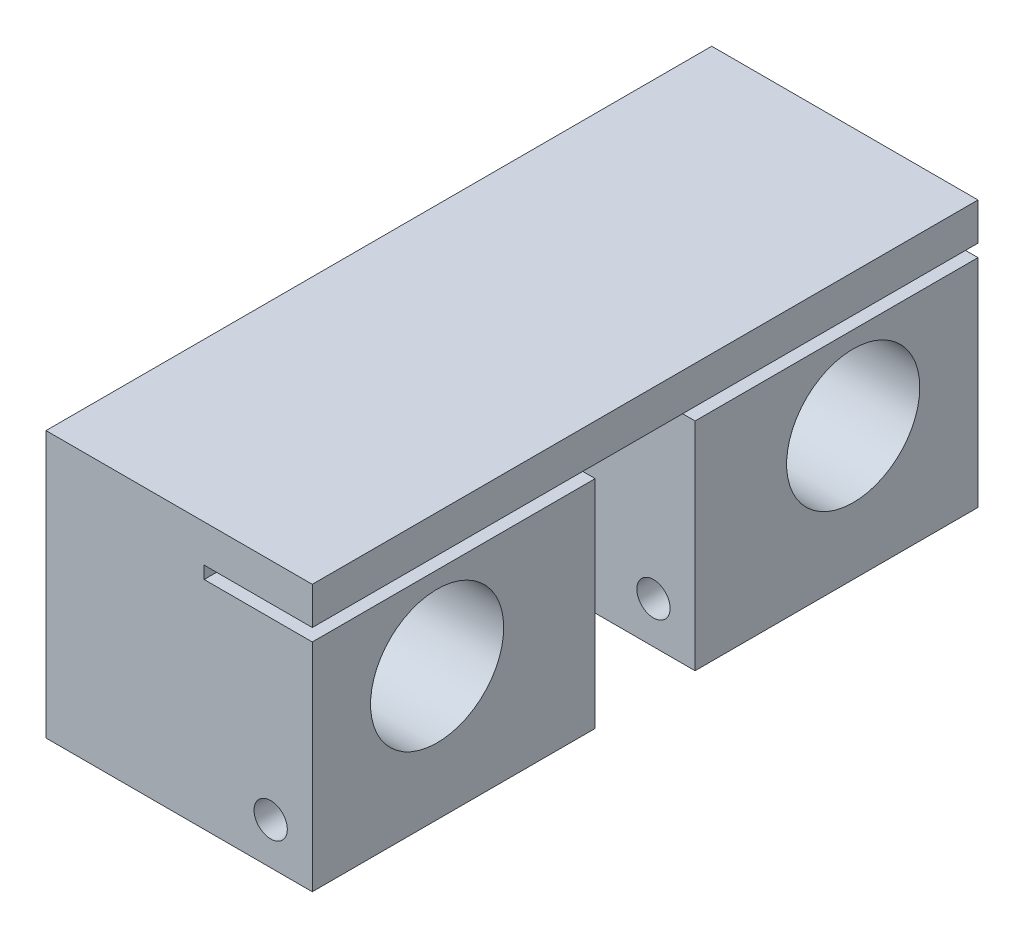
ISO-10303-21;
HEADER;
FILE_DESCRIPTION(('STEP AP214'),'2;1');
FILE_NAME('part.step','',(''),(''),'','','');
FILE_SCHEMA(('AUTOMOTIVE_DESIGN { 1 0 10303 214 1 1 1 1 }'));
ENDSEC;
DATA;
#1=APPLICATION_CONTEXT('core data for automotive mechanical design processes');
#2=APPLICATION_PROTOCOL_DEFINITION('international standard','automotive_design',2000,#1);
#3=PRODUCT_CONTEXT('',#1,'mechanical');
#4=PRODUCT('Part','Part','',(#3));
#5=PRODUCT_RELATED_PRODUCT_CATEGORY('part','',(#4));
#6=PRODUCT_DEFINITION_FORMATION('','',#4);
#7=PRODUCT_DEFINITION_CONTEXT('part definition',#1,'design');
#8=PRODUCT_DEFINITION('design','',#6,#7);
#9=PRODUCT_DEFINITION_SHAPE('','',#8);
#10=(LENGTH_UNIT() NAMED_UNIT(*) SI_UNIT(.MILLI.,.METRE.));
#11=(NAMED_UNIT(*) PLANE_ANGLE_UNIT() SI_UNIT($,.RADIAN.));
#12=(NAMED_UNIT(*) SI_UNIT($,.STERADIAN.) SOLID_ANGLE_UNIT());
#13=UNCERTAINTY_MEASURE_WITH_UNIT(LENGTH_MEASURE(1.E-05),#10,'distance_accuracy_value','');
#14=(GEOMETRIC_REPRESENTATION_CONTEXT(3) GLOBAL_UNCERTAINTY_ASSIGNED_CONTEXT((#13)) GLOBAL_UNIT_ASSIGNED_CONTEXT((#10,
#11,#12)) REPRESENTATION_CONTEXT('',''));
#15=CARTESIAN_POINT('',(0.,0.,0.));
#16=DIRECTION('',(0.,0.,1.));
#17=DIRECTION('',(1.,0.,0.));
#18=AXIS2_PLACEMENT_3D('',#15,#16,#17);
#19=CARTESIAN_POINT('',(0.,0.,39.9999999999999));
#20=DIRECTION('',(-0.999999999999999,0.,0.));
#21=DIRECTION('',(0.,0.,0.999999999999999));
#22=AXIS2_PLACEMENT_3D('',#19,#20,#21);
#23=PLANE('',#22);
#24=CARTESIAN_POINT('',(0.,4.,26.));
#25=DIRECTION('',(-0.999999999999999,0.,0.));
#26=DIRECTION('',(0.,0.,0.999999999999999));
#27=AXIS2_PLACEMENT_3D('',#24,#25,#26);
#28=CIRCLE('',#27,1.5);
#29=CARTESIAN_POINT('',(0.,4.,27.5));
#30=VERTEX_POINT('',#29);
#31=EDGE_CURVE('E177',#30,#30,#28,.T.);
#32=ORIENTED_EDGE('',*,*,#31,.F.);
#33=EDGE_LOOP('',(#32));
#34=FACE_BOUND('',#33,.T.);
#35=CARTESIAN_POINT('',(0.,12.,26.));
#36=DIRECTION('',(-0.999999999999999,0.,0.));
#37=DIRECTION('',(0.,0.,0.999999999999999));
#38=AXIS2_PLACEMENT_3D('',#35,#36,#37);
#39=CIRCLE('',#38,1.5);
#40=CARTESIAN_POINT('',(0.,12.,27.5));
#41=VERTEX_POINT('',#40);
#42=EDGE_CURVE('E181',#41,#41,#39,.T.);
#43=ORIENTED_EDGE('',*,*,#42,.F.);
#44=EDGE_LOOP('',(#43));
#45=FACE_BOUND('',#44,.T.);
#46=DIRECTION('',(0.,0.999999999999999,0.));
#47=VECTOR('',#46,1.);
#48=CARTESIAN_POINT('',(0.,0.,0.));
#49=LINE('',#48,#47);
#50=CARTESIAN_POINT('',(0.,0.,0.));
#51=VERTEX_POINT('',#50);
#52=CARTESIAN_POINT('',(0.,16.,0.));
#53=VERTEX_POINT('',#52);
#54=EDGE_CURVE('E185',#51,#53,#49,.T.);
#55=ORIENTED_EDGE('',*,*,#54,.F.);
#56=DIRECTION('',(0.,0.,-0.999999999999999));
#57=VECTOR('',#56,1.);
#58=CARTESIAN_POINT('',(0.,0.,39.9999999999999));
#59=LINE('',#58,#57);
#60=CARTESIAN_POINT('',(0.,0.,39.9999999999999));
#61=VERTEX_POINT('',#60);
#62=EDGE_CURVE('E49',#61,#51,#59,.T.);
#63=ORIENTED_EDGE('',*,*,#62,.F.);
#64=DIRECTION('',(0.,0.999999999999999,0.));
#65=VECTOR('',#64,1.);
#66=CARTESIAN_POINT('',(0.,0.,39.9999999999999));
#67=LINE('',#66,#65);
#68=CARTESIAN_POINT('',(0.,16.,39.9999999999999));
#69=VERTEX_POINT('',#68);
#70=EDGE_CURVE('E296',#61,#69,#67,.T.);
#71=ORIENTED_EDGE('',*,*,#70,.T.);
#72=DIRECTION('',(0.,0.,-0.999999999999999));
#73=VECTOR('',#72,1.);
#74=CARTESIAN_POINT('',(0.,16.,39.9999999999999));
#75=LINE('',#74,#73);
#76=EDGE_CURVE('E308',#69,#53,#75,.T.);
#77=ORIENTED_EDGE('',*,*,#76,.T.);
#78=EDGE_LOOP('',(#55,#63,#71,#77));
#79=FACE_BOUND('',#78,.T.);
#80=CARTESIAN_POINT('',(0.,8.,32.4999999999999));
#81=DIRECTION('',(0.999999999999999,0.,0.));
#82=DIRECTION('',(0.,0.,-0.999999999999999));
#83=AXIS2_PLACEMENT_3D('',#80,#81,#82);
#84=CIRCLE('',#83,4.);
#85=CARTESIAN_POINT('',(0.,8.,28.4999999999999));
#86=VERTEX_POINT('',#85);
#87=EDGE_CURVE('E189',#86,#86,#84,.T.);
#88=ORIENTED_EDGE('',*,*,#87,.T.);
#89=EDGE_LOOP('',(#88));
#90=FACE_BOUND('',#89,.T.);
#91=CARTESIAN_POINT('',(0.,8.,7.49999999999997));
#92=DIRECTION('',(-0.999999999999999,0.,0.));
#93=DIRECTION('',(0.,0.,0.999999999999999));
#94=AXIS2_PLACEMENT_3D('',#91,#92,#93);
#95=CIRCLE('',#94,4.);
#96=CARTESIAN_POINT('',(0.,8.,3.49999999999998));
#97=VERTEX_POINT('',#96);
#98=EDGE_CURVE('E193',#97,#97,#95,.T.);
#99=ORIENTED_EDGE('',*,*,#98,.F.);
#100=EDGE_LOOP('',(#99));
#101=FACE_BOUND('',#100,.T.);
#102=CARTESIAN_POINT('',(0.,12.,14.));
#103=DIRECTION('',(-0.999999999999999,0.,0.));
#104=DIRECTION('',(0.,0.,0.999999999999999));
#105=AXIS2_PLACEMENT_3D('',#102,#103,#104);
#106=CIRCLE('',#105,1.5);
#107=CARTESIAN_POINT('',(0.,12.,15.5));
#108=VERTEX_POINT('',#107);
#109=EDGE_CURVE('E197',#108,#108,#106,.T.);
#110=ORIENTED_EDGE('',*,*,#109,.F.);
#111=EDGE_LOOP('',(#110));
#112=FACE_BOUND('',#111,.T.);
#113=CARTESIAN_POINT('',(0.,4.,14.));
#114=DIRECTION('',(-0.999999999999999,0.,0.));
#115=DIRECTION('',(0.,0.,0.999999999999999));
#116=AXIS2_PLACEMENT_3D('',#113,#114,#115);
#117=CIRCLE('',#116,1.5);
#118=CARTESIAN_POINT('',(0.,4.,15.5));
#119=VERTEX_POINT('',#118);
#120=EDGE_CURVE('E200',#119,#119,#117,.T.);
#121=ORIENTED_EDGE('',*,*,#120,.F.);
#122=EDGE_LOOP('',(#121));
#123=FACE_BOUND('',#122,.T.);
#124=ADVANCED_FACE('F41',(#34,#45,#79,#90,#101,#112,#123),#23,.T.);
#125=CARTESIAN_POINT('',(16.,16.,39.9999999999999));
#126=DIRECTION('',(0.999999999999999,0.,0.));
#127=DIRECTION('',(0.,0.,-0.999999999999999));
#128=AXIS2_PLACEMENT_3D('',#125,#126,#127);
#129=PLANE('',#128);
#130=DIRECTION('',(0.,-0.999999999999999,0.));
#131=VECTOR('',#130,1.);
#132=CARTESIAN_POINT('',(16.,16.,39.9999999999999));
#133=LINE('',#132,#131);
#134=CARTESIAN_POINT('',(16.,16.,39.9999999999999));
#135=VERTEX_POINT('',#134);
#136=CARTESIAN_POINT('',(16.,13.75,39.9999999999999));
#137=VERTEX_POINT('',#136);
#138=EDGE_CURVE('E302',#135,#137,#133,.T.);
#139=ORIENTED_EDGE('',*,*,#138,.T.);
#140=DIRECTION('',(0.,0.,-0.999999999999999));
#141=VECTOR('',#140,1.);
#142=CARTESIAN_POINT('',(16.,13.75,39.9999999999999));
#143=LINE('',#142,#141);
#144=CARTESIAN_POINT('',(16.,13.75,0.));
#145=VERTEX_POINT('',#144);
#146=EDGE_CURVE('E226',#137,#145,#143,.T.);
#147=ORIENTED_EDGE('',*,*,#146,.T.);
#148=DIRECTION('',(0.,-0.999999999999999,0.));
#149=VECTOR('',#148,1.);
#150=CARTESIAN_POINT('',(16.,16.,0.));
#151=LINE('',#150,#149);
#152=CARTESIAN_POINT('',(16.,16.,0.));
#153=VERTEX_POINT('',#152);
#154=EDGE_CURVE('E290',#153,#145,#151,.T.);
#155=ORIENTED_EDGE('',*,*,#154,.F.);
#156=DIRECTION('',(0.,0.,-0.999999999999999));
#157=VECTOR('',#156,1.);
#158=CARTESIAN_POINT('',(16.,16.,39.9999999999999));
#159=LINE('',#158,#157);
#160=EDGE_CURVE('E313',#135,#153,#159,.T.);
#161=ORIENTED_EDGE('',*,*,#160,.F.);
#162=EDGE_LOOP('',(#139,#147,#155,#161));
#163=FACE_BOUND('',#162,.T.);
#164=ADVANCED_FACE('F165',(#163),#129,.T.);
#165=DIRECTION('',(0.,0.,-0.999999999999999));
#166=VECTOR('',#165,1.);
#167=CARTESIAN_POINT('',(16.,13.,39.9999999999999));
#168=LINE('',#167,#166);
#169=CARTESIAN_POINT('',(16.,13.,39.9999999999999));
#170=VERTEX_POINT('',#169);
#171=CARTESIAN_POINT('',(16.,13.,23.));
#172=VERTEX_POINT('',#171);
#173=EDGE_CURVE('E230',#170,#172,#168,.T.);
#174=ORIENTED_EDGE('',*,*,#173,.F.);
#175=CARTESIAN_POINT('',(16.,0.,39.9999999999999));
#176=VERTEX_POINT('',#175);
#177=EDGE_CURVE('E301',#170,#176,#133,.T.);
#178=ORIENTED_EDGE('',*,*,#177,.T.);
#179=DIRECTION('',(0.,0.,-0.999999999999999));
#180=VECTOR('',#179,1.);
#181=CARTESIAN_POINT('',(16.,0.,39.9999999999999));
#182=LINE('',#181,#180);
#183=CARTESIAN_POINT('',(16.,0.,23.));
#184=VERTEX_POINT('',#183);
#185=EDGE_CURVE('E310',#176,#184,#182,.T.);
#186=ORIENTED_EDGE('',*,*,#185,.T.);
#187=DIRECTION('',(0.,-0.999999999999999,0.));
#188=VECTOR('',#187,1.);
#189=CARTESIAN_POINT('',(16.,13.,23.));
#190=LINE('',#189,#188);
#191=EDGE_CURVE('E63',#172,#184,#190,.T.);
#192=ORIENTED_EDGE('',*,*,#191,.F.);
#193=EDGE_LOOP('',(#174,#178,#186,#192));
#194=FACE_BOUND('',#193,.T.);
#195=CARTESIAN_POINT('',(16.,8.,32.4999999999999));
#196=DIRECTION('',(0.999999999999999,0.,0.));
#197=DIRECTION('',(0.,0.,-0.999999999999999));
#198=AXIS2_PLACEMENT_3D('',#195,#196,#197);
#199=CIRCLE('',#198,4.);
#200=CARTESIAN_POINT('',(16.,8.,28.4999999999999));
#201=VERTEX_POINT('',#200);
#202=EDGE_CURVE('E281',#201,#201,#199,.T.);
#203=ORIENTED_EDGE('',*,*,#202,.F.);
#204=EDGE_LOOP('',(#203));
#205=FACE_BOUND('',#204,.T.);
#206=ADVANCED_FACE('F170',(#194,#205),#129,.T.);
#207=CARTESIAN_POINT('',(0.,16.,39.9999999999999));
#208=DIRECTION('',(0.,0.,0.999999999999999));
#209=DIRECTION('',(0.999999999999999,0.,0.));
#210=AXIS2_PLACEMENT_3D('',#207,#208,#209);
#211=PLANE('',#210);
#212=CARTESIAN_POINT('',(13.5,2.49999999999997,39.9999999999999));
#213=DIRECTION('',(0.,0.,0.999999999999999));
#214=DIRECTION('',(0.999999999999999,0.,0.));
#215=AXIS2_PLACEMENT_3D('',#212,#213,#214);
#216=CIRCLE('',#215,1.);
#217=CARTESIAN_POINT('',(14.5,2.49999999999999,39.9999999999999));
#218=VERTEX_POINT('',#217);
#219=EDGE_CURVE('E217',#218,#218,#216,.T.);
#220=ORIENTED_EDGE('',*,*,#219,.F.);
#221=EDGE_LOOP('',(#220));
#222=FACE_BOUND('',#221,.T.);
#223=DIRECTION('',(0.,0.999999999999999,0.));
#224=VECTOR('',#223,1.);
#225=CARTESIAN_POINT('',(9.5,13.,39.9999999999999));
#226=LINE('',#225,#224);
#227=CARTESIAN_POINT('',(9.5,13.,39.9999999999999));
#228=VERTEX_POINT('',#227);
#229=CARTESIAN_POINT('',(9.5,13.75,39.9999999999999));
#230=VERTEX_POINT('',#229);
#231=EDGE_CURVE('E232',#228,#230,#226,.T.);
#232=ORIENTED_EDGE('',*,*,#231,.T.);
#233=DIRECTION('',(0.999999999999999,0.,0.));
#234=VECTOR('',#233,1.);
#235=CARTESIAN_POINT('',(9.5,13.75,39.9999999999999));
#236=LINE('',#235,#234);
#237=EDGE_CURVE('E249',#230,#137,#236,.T.);
#238=ORIENTED_EDGE('',*,*,#237,.T.);
#239=ORIENTED_EDGE('',*,*,#138,.F.);
#240=DIRECTION('',(-0.999999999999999,0.,0.));
#241=VECTOR('',#240,1.);
#242=CARTESIAN_POINT('',(16.,16.,39.9999999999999));
#243=LINE('',#242,#241);
#244=EDGE_CURVE('E299',#135,#69,#243,.T.);
#245=ORIENTED_EDGE('',*,*,#244,.T.);
#246=ORIENTED_EDGE('',*,*,#70,.F.);
#247=DIRECTION('',(0.999999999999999,0.,0.));
#248=VECTOR('',#247,1.);
#249=CARTESIAN_POINT('',(0.,0.,39.9999999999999));
#250=LINE('',#249,#248);
#251=EDGE_CURVE('E305',#61,#176,#250,.T.);
#252=ORIENTED_EDGE('',*,*,#251,.T.);
#253=ORIENTED_EDGE('',*,*,#177,.F.);
#254=DIRECTION('',(0.999999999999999,0.,0.));
#255=VECTOR('',#254,1.);
#256=CARTESIAN_POINT('',(9.5,13.,39.9999999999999));
#257=LINE('',#256,#255);
#258=EDGE_CURVE('E242',#228,#170,#257,.T.);
#259=ORIENTED_EDGE('',*,*,#258,.F.);
#260=EDGE_LOOP('',(#232,#238,#239,#245,#246,#252,#253,#259));
#261=FACE_BOUND('',#260,.T.);
#262=ADVANCED_FACE('F337',(#222,#261),#211,.T.);
#263=CARTESIAN_POINT('',(0.,16.,0.));
#264=DIRECTION('',(0.,0.,0.999999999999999));
#265=DIRECTION('',(0.999999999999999,0.,0.));
#266=AXIS2_PLACEMENT_3D('',#263,#264,#265);
#267=PLANE('',#266);
#268=CARTESIAN_POINT('',(13.5,2.5,0.));
#269=DIRECTION('',(0.,0.,0.999999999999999));
#270=DIRECTION('',(0.999999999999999,0.,0.));
#271=AXIS2_PLACEMENT_3D('',#268,#269,#270);
#272=CIRCLE('',#271,1.);
#273=CARTESIAN_POINT('',(14.5,2.5,0.));
#274=VERTEX_POINT('',#273);
#275=EDGE_CURVE('E220',#274,#274,#272,.T.);
#276=ORIENTED_EDGE('',*,*,#275,.T.);
#277=EDGE_LOOP('',(#276));
#278=FACE_BOUND('',#277,.T.);
#279=DIRECTION('',(0.999999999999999,0.,0.));
#280=VECTOR('',#279,1.);
#281=CARTESIAN_POINT('',(9.49999999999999,13.75,0.));
#282=LINE('',#281,#280);
#283=CARTESIAN_POINT('',(9.49999999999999,13.75,0.));
#284=VERTEX_POINT('',#283);
#285=EDGE_CURVE('E247',#284,#145,#282,.T.);
#286=ORIENTED_EDGE('',*,*,#285,.F.);
#287=DIRECTION('',(0.,0.999999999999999,0.));
#288=VECTOR('',#287,1.);
#289=CARTESIAN_POINT('',(9.5,13.,0.));
#290=LINE('',#289,#288);
#291=CARTESIAN_POINT('',(9.5,13.,0.));
#292=VERTEX_POINT('',#291);
#293=EDGE_CURVE('E237',#292,#284,#290,.T.);
#294=ORIENTED_EDGE('',*,*,#293,.F.);
#295=DIRECTION('',(0.999999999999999,0.,0.));
#296=VECTOR('',#295,1.);
#297=CARTESIAN_POINT('',(9.5,13.,0.));
#298=LINE('',#297,#296);
#299=CARTESIAN_POINT('',(16.,13.,0.));
#300=VERTEX_POINT('',#299);
#301=EDGE_CURVE('E244',#292,#300,#298,.T.);
#302=ORIENTED_EDGE('',*,*,#301,.T.);
#303=CARTESIAN_POINT('',(16.,0.,0.));
#304=VERTEX_POINT('',#303);
#305=EDGE_CURVE('E289',#300,#304,#151,.T.);
#306=ORIENTED_EDGE('',*,*,#305,.T.);
#307=DIRECTION('',(0.999999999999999,0.,0.));
#308=VECTOR('',#307,1.);
#309=CARTESIAN_POINT('',(0.,0.,0.));
#310=LINE('',#309,#308);
#311=EDGE_CURVE('E293',#51,#304,#310,.T.);
#312=ORIENTED_EDGE('',*,*,#311,.F.);
#313=ORIENTED_EDGE('',*,*,#54,.T.);
#314=DIRECTION('',(-0.999999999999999,0.,0.));
#315=VECTOR('',#314,1.);
#316=CARTESIAN_POINT('',(16.,16.,0.));
#317=LINE('',#316,#315);
#318=EDGE_CURVE('E286',#153,#53,#317,.T.);
#319=ORIENTED_EDGE('',*,*,#318,.F.);
#320=ORIENTED_EDGE('',*,*,#154,.T.);
#321=EDGE_LOOP('',(#286,#294,#302,#306,#312,#313,#319,#320));
#322=FACE_BOUND('',#321,.T.);
#323=ADVANCED_FACE('F326',(#278,#322),#267,.F.);
#324=CARTESIAN_POINT('',(16.,13.,17.));
#325=VERTEX_POINT('',#324);
#326=EDGE_CURVE('E229',#325,#300,#168,.T.);
#327=ORIENTED_EDGE('',*,*,#326,.F.);
#328=DIRECTION('',(0.,-0.999999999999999,0.));
#329=VECTOR('',#328,1.);
#330=CARTESIAN_POINT('',(16.,13.,17.));
#331=LINE('',#330,#329);
#332=CARTESIAN_POINT('',(16.,0.,17.));
#333=VERTEX_POINT('',#332);
#334=EDGE_CURVE('E274',#325,#333,#331,.T.);
#335=ORIENTED_EDGE('',*,*,#334,.T.);
#336=EDGE_CURVE('E312',#333,#304,#182,.T.);
#337=ORIENTED_EDGE('',*,*,#336,.T.);
#338=ORIENTED_EDGE('',*,*,#305,.F.);
#339=EDGE_LOOP('',(#327,#335,#337,#338));
#340=FACE_BOUND('',#339,.T.);
#341=CARTESIAN_POINT('',(16.,7.99999999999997,7.49999999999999));
#342=DIRECTION('',(-0.999999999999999,0.,0.));
#343=DIRECTION('',(0.,0.,0.999999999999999));
#344=AXIS2_PLACEMENT_3D('',#341,#342,#343);
#345=CIRCLE('',#344,4.);
#346=CARTESIAN_POINT('',(16.,8.,3.49999999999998));
#347=VERTEX_POINT('',#346);
#348=EDGE_CURVE('E277',#347,#347,#345,.T.);
#349=ORIENTED_EDGE('',*,*,#348,.T.);
#350=EDGE_LOOP('',(#349));
#351=FACE_BOUND('',#350,.T.);
#352=ADVANCED_FACE('F173',(#340,#351),#129,.T.);
#353=CARTESIAN_POINT('',(0.,0.,39.9999999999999));
#354=DIRECTION('',(0.,0.999999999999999,0.));
#355=DIRECTION('',(0.,0.,0.999999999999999));
#356=AXIS2_PLACEMENT_3D('',#353,#354,#355);
#357=PLANE('',#356);
#358=ORIENTED_EDGE('',*,*,#336,.F.);
#359=DIRECTION('',(0.999999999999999,0.,0.));
#360=VECTOR('',#359,1.);
#361=CARTESIAN_POINT('',(4.5,0.,17.));
#362=LINE('',#361,#360);
#363=CARTESIAN_POINT('',(4.5,0.,17.));
#364=VERTEX_POINT('',#363);
#365=EDGE_CURVE('E252',#364,#333,#362,.T.);
#366=ORIENTED_EDGE('',*,*,#365,.F.);
#367=CARTESIAN_POINT('',(4.50000000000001,0.,20.));
#368=DIRECTION('',(0.,-0.999999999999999,0.));
#369=DIRECTION('',(0.,0.,-0.999999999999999));
#370=AXIS2_PLACEMENT_3D('',#367,#368,#369);
#371=CIRCLE('',#370,3.);
#372=CARTESIAN_POINT('',(4.5,0.,23.));
#373=VERTEX_POINT('',#372);
#374=EDGE_CURVE('E254',#373,#364,#371,.T.);
#375=ORIENTED_EDGE('',*,*,#374,.F.);
#376=DIRECTION('',(-0.999999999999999,0.,0.));
#377=VECTOR('',#376,1.);
#378=CARTESIAN_POINT('',(16.,0.,23.));
#379=LINE('',#378,#377);
#380=EDGE_CURVE('E257',#184,#373,#379,.T.);
#381=ORIENTED_EDGE('',*,*,#380,.F.);
#382=ORIENTED_EDGE('',*,*,#185,.F.);
#383=ORIENTED_EDGE('',*,*,#251,.F.);
#384=ORIENTED_EDGE('',*,*,#62,.T.);
#385=ORIENTED_EDGE('',*,*,#311,.T.);
#386=EDGE_LOOP('',(#358,#366,#375,#381,#382,#383,#384,#385));
#387=FACE_BOUND('',#386,.T.);
#388=ADVANCED_FACE('F331',(#387),#357,.F.);
#389=CARTESIAN_POINT('',(16.,16.,39.9999999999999));
#390=DIRECTION('',(0.,-0.999999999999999,0.));
#391=DIRECTION('',(0.,0.,-0.999999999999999));
#392=AXIS2_PLACEMENT_3D('',#389,#390,#391);
#393=PLANE('',#392);
#394=ORIENTED_EDGE('',*,*,#318,.T.);
#395=ORIENTED_EDGE('',*,*,#76,.F.);
#396=ORIENTED_EDGE('',*,*,#244,.F.);
#397=ORIENTED_EDGE('',*,*,#160,.T.);
#398=EDGE_LOOP('',(#394,#395,#396,#397));
#399=FACE_BOUND('',#398,.T.);
#400=ADVANCED_FACE('F321',(#399),#393,.F.);
#401=CARTESIAN_POINT('',(0.,8.,32.4999999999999));
#402=DIRECTION('',(0.999999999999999,0.,0.));
#403=DIRECTION('',(0.,0.,-0.999999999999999));
#404=AXIS2_PLACEMENT_3D('',#401,#402,#403);
#405=CYLINDRICAL_SURFACE('',#404,4.);
#406=CARTESIAN_POINT('',(0.,8.,28.4999999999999));
#407=CARTESIAN_POINT('',(0.166666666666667,8.,28.4999999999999));
#408=CARTESIAN_POINT('',(0.333333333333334,8.,28.4999999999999));
#409=CARTESIAN_POINT('',(0.666666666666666,8.,28.4999999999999));
#410=CARTESIAN_POINT('',(0.833333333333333,8.,28.4999999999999));
#411=CARTESIAN_POINT('',(1.16666666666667,8.,28.4999999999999));
#412=CARTESIAN_POINT('',(1.33333333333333,8.,28.4999999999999));
#413=CARTESIAN_POINT('',(1.66666666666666,8.,28.4999999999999));
#414=CARTESIAN_POINT('',(1.83333333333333,8.,28.4999999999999));
#415=CARTESIAN_POINT('',(2.16666666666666,8.,28.4999999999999));
#416=CARTESIAN_POINT('',(2.33333333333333,8.,28.4999999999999));
#417=CARTESIAN_POINT('',(2.66666666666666,8.,28.4999999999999));
#418=CARTESIAN_POINT('',(2.83333333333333,8.,28.4999999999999));
#419=CARTESIAN_POINT('',(3.16666666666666,8.,28.4999999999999));
#420=CARTESIAN_POINT('',(3.33333333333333,8.,28.4999999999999));
#421=CARTESIAN_POINT('',(3.66666666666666,8.,28.4999999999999));
#422=CARTESIAN_POINT('',(3.83333333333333,8.,28.4999999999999));
#423=CARTESIAN_POINT('',(4.16666666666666,8.,28.4999999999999));
#424=CARTESIAN_POINT('',(4.33333333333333,8.,28.4999999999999));
#425=CARTESIAN_POINT('',(4.66666666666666,8.,28.4999999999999));
#426=CARTESIAN_POINT('',(4.83333333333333,8.,28.4999999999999));
#427=CARTESIAN_POINT('',(5.16666666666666,8.,28.4999999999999));
#428=CARTESIAN_POINT('',(5.33333333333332,8.,28.4999999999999));
#429=CARTESIAN_POINT('',(5.66666666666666,8.,28.4999999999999));
#430=CARTESIAN_POINT('',(5.83333333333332,8.,28.4999999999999));
#431=CARTESIAN_POINT('',(6.16666666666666,8.,28.4999999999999));
#432=CARTESIAN_POINT('',(6.33333333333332,8.,28.4999999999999));
#433=CARTESIAN_POINT('',(6.66666666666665,8.,28.4999999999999));
#434=CARTESIAN_POINT('',(6.83333333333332,8.,28.4999999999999));
#435=CARTESIAN_POINT('',(7.16666666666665,8.,28.4999999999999));
#436=CARTESIAN_POINT('',(7.33333333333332,8.,28.4999999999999));
#437=CARTESIAN_POINT('',(7.66666666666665,8.,28.4999999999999));
#438=CARTESIAN_POINT('',(7.83333333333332,8.,28.4999999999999));
#439=CARTESIAN_POINT('',(8.16666666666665,8.,28.4999999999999));
#440=CARTESIAN_POINT('',(8.33333333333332,8.,28.4999999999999));
#441=CARTESIAN_POINT('',(8.66666666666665,8.,28.4999999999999));
#442=CARTESIAN_POINT('',(8.83333333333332,8.,28.4999999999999));
#443=CARTESIAN_POINT('',(9.16666666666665,8.,28.4999999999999));
#444=CARTESIAN_POINT('',(9.33333333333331,8.,28.4999999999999));
#445=CARTESIAN_POINT('',(9.66666666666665,8.,28.4999999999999));
#446=CARTESIAN_POINT('',(9.83333333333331,8.,28.4999999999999));
#447=CARTESIAN_POINT('',(10.1666666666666,8.,28.4999999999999));
#448=CARTESIAN_POINT('',(10.3333333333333,8.,28.4999999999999));
#449=CARTESIAN_POINT('',(10.6666666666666,8.,28.4999999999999));
#450=CARTESIAN_POINT('',(10.8333333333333,8.,28.4999999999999));
#451=CARTESIAN_POINT('',(11.1666666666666,8.,28.4999999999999));
#452=CARTESIAN_POINT('',(11.3333333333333,8.,28.4999999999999));
#453=CARTESIAN_POINT('',(11.6666666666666,8.,28.4999999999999));
#454=CARTESIAN_POINT('',(11.8333333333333,8.,28.4999999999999));
#455=CARTESIAN_POINT('',(12.1666666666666,8.,28.4999999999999));
#456=CARTESIAN_POINT('',(12.3333333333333,8.,28.4999999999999));
#457=CARTESIAN_POINT('',(12.6666666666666,8.,28.4999999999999));
#458=CARTESIAN_POINT('',(12.8333333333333,8.,28.4999999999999));
#459=CARTESIAN_POINT('',(13.1666666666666,8.,28.4999999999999));
#460=CARTESIAN_POINT('',(13.3333333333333,8.,28.4999999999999));
#461=CARTESIAN_POINT('',(13.6666666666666,8.,28.4999999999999));
#462=CARTESIAN_POINT('',(13.8333333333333,8.,28.4999999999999));
#463=CARTESIAN_POINT('',(14.1666666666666,8.,28.4999999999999));
#464=CARTESIAN_POINT('',(14.3333333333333,8.,28.4999999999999));
#465=CARTESIAN_POINT('',(14.6666666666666,8.,28.4999999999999));
#466=CARTESIAN_POINT('',(14.8333333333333,8.,28.4999999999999));
#467=CARTESIAN_POINT('',(15.1666666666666,8.,28.4999999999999));
#468=CARTESIAN_POINT('',(15.3333333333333,8.,28.4999999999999));
#469=CARTESIAN_POINT('',(15.6666666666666,8.,28.4999999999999));
#470=CARTESIAN_POINT('',(15.8333333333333,8.,28.4999999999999));
#471=CARTESIAN_POINT('',(16.,8.,28.4999999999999));
#472=B_SPLINE_CURVE_WITH_KNOTS('',3,(#406,#407,#408,#409,#410,#411,#412,#413,#414,#415,#416,
#417,#418,#419,#420,#421,#422,#423,#424,#425,#426,#427,#428,#429,#430,#431,#432,#433,#434,#435,
#436,#437,#438,#439,#440,#441,#442,#443,#444,#445,#446,#447,#448,#449,#450,#451,#452,#453,#454,
#455,#456,#457,#458,#459,#460,#461,#462,#463,#464,#465,#466,#467,#468,#469,#470,#471),
.UNSPECIFIED.,.F.,.F.,(4,2,2,2,2,2,2,2,2,2,2,2,2,2,2,2,2,2,2,2,2,2,2,2,2,2,2,2,2,2,2,2,4),(0.,
0.499999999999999,0.999999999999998,1.5,2.,2.5,2.99999999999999,3.49999999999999,
3.99999999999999,4.49999999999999,4.99999999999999,5.49999999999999,5.99999999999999,
6.49999999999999,6.99999999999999,7.49999999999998,7.99999999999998,8.49999999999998,
8.99999999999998,9.49999999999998,9.99999999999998,10.5,11.,11.5,12.,12.5,13.,13.5,14.,14.5,15.,
15.5,16.),.UNSPECIFIED.);
#473=EDGE_CURVE('BSEAM383',#86,#201,#472,.T.);
#474=ORIENTED_EDGE('',*,*,#87,.F.);
#475=ORIENTED_EDGE('',*,*,#202,.T.);
#476=ORIENTED_EDGE('',*,*,#473,.T.);
#477=ORIENTED_EDGE('',*,*,#473,.F.);
#478=EDGE_LOOP('',(#474,#476,#475,#477));
#479=FACE_BOUND('',#478,.T.);
#480=ADVANCED_FACE('F383',(#479),#405,.F.);
#481=CARTESIAN_POINT('',(0.,8.,7.49999999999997));
#482=DIRECTION('',(0.999999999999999,0.,0.));
#483=DIRECTION('',(0.,0.,-0.999999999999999));
#484=AXIS2_PLACEMENT_3D('',#481,#482,#483);
#485=CYLINDRICAL_SURFACE('',#484,4.);
#486=CARTESIAN_POINT('',(0.,8.,3.49999999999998));
#487=CARTESIAN_POINT('',(0.166666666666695,8.,3.49999999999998));
#488=CARTESIAN_POINT('',(0.333333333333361,8.,3.49999999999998));
#489=CARTESIAN_POINT('',(0.666666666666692,8.,3.49999999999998));
#490=CARTESIAN_POINT('',(0.833333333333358,8.,3.49999999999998));
#491=CARTESIAN_POINT('',(1.16666666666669,8.,3.49999999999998));
#492=CARTESIAN_POINT('',(1.33333333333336,8.,3.49999999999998));
#493=CARTESIAN_POINT('',(1.66666666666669,8.,3.49999999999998));
#494=CARTESIAN_POINT('',(1.83333333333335,8.,3.49999999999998));
#495=CARTESIAN_POINT('',(2.16666666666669,8.,3.49999999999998));
#496=CARTESIAN_POINT('',(2.33333333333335,8.,3.49999999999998));
#497=CARTESIAN_POINT('',(2.66666666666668,8.,3.49999999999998));
#498=CARTESIAN_POINT('',(2.83333333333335,8.,3.49999999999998));
#499=CARTESIAN_POINT('',(3.16666666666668,8.,3.49999999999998));
#500=CARTESIAN_POINT('',(3.33333333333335,8.,3.49999999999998));
#501=CARTESIAN_POINT('',(3.66666666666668,8.,3.49999999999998));
#502=CARTESIAN_POINT('',(3.83333333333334,8.,3.49999999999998));
#503=CARTESIAN_POINT('',(4.16666666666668,8.,3.49999999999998));
#504=CARTESIAN_POINT('',(4.33333333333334,8.,3.49999999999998));
#505=CARTESIAN_POINT('',(4.66666666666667,8.,3.49999999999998));
#506=CARTESIAN_POINT('',(4.83333333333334,8.,3.49999999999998));
#507=CARTESIAN_POINT('',(5.16666666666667,8.,3.49999999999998));
#508=CARTESIAN_POINT('',(5.33333333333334,8.,3.49999999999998));
#509=CARTESIAN_POINT('',(5.66666666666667,8.,3.49999999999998));
#510=CARTESIAN_POINT('',(5.83333333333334,8.,3.49999999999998));
#511=CARTESIAN_POINT('',(6.16666666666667,8.,3.49999999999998));
#512=CARTESIAN_POINT('',(6.33333333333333,8.,3.49999999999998));
#513=CARTESIAN_POINT('',(6.66666666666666,8.,3.49999999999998));
#514=CARTESIAN_POINT('',(6.83333333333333,8.,3.49999999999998));
#515=CARTESIAN_POINT('',(7.16666666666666,8.,3.49999999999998));
#516=CARTESIAN_POINT('',(7.33333333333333,8.,3.49999999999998));
#517=CARTESIAN_POINT('',(7.66666666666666,8.,3.49999999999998));
#518=CARTESIAN_POINT('',(7.83333333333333,8.,3.49999999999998));
#519=CARTESIAN_POINT('',(8.16666666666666,8.,3.49999999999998));
#520=CARTESIAN_POINT('',(8.33333333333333,8.,3.49999999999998));
#521=CARTESIAN_POINT('',(8.66666666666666,8.,3.49999999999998));
#522=CARTESIAN_POINT('',(8.83333333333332,8.,3.49999999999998));
#523=CARTESIAN_POINT('',(9.16666666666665,8.,3.49999999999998));
#524=CARTESIAN_POINT('',(9.33333333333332,8.,3.49999999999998));
#525=CARTESIAN_POINT('',(9.66666666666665,8.,3.49999999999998));
#526=CARTESIAN_POINT('',(9.83333333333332,8.,3.49999999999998));
#527=CARTESIAN_POINT('',(10.1666666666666,8.,3.49999999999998));
#528=CARTESIAN_POINT('',(10.3333333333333,8.,3.49999999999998));
#529=CARTESIAN_POINT('',(10.6666666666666,8.,3.49999999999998));
#530=CARTESIAN_POINT('',(10.8333333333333,8.,3.49999999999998));
#531=CARTESIAN_POINT('',(11.1666666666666,8.,3.49999999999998));
#532=CARTESIAN_POINT('',(11.3333333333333,8.,3.49999999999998));
#533=CARTESIAN_POINT('',(11.6666666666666,8.,3.49999999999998));
#534=CARTESIAN_POINT('',(11.8333333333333,8.,3.49999999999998));
#535=CARTESIAN_POINT('',(12.1666666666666,8.,3.49999999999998));
#536=CARTESIAN_POINT('',(12.3333333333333,8.,3.49999999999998));
#537=CARTESIAN_POINT('',(12.6666666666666,8.,3.49999999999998));
#538=CARTESIAN_POINT('',(12.8333333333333,8.,3.49999999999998));
#539=CARTESIAN_POINT('',(13.1666666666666,8.,3.49999999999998));
#540=CARTESIAN_POINT('',(13.3333333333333,8.,3.49999999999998));
#541=CARTESIAN_POINT('',(13.6666666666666,8.,3.49999999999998));
#542=CARTESIAN_POINT('',(13.8333333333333,8.,3.49999999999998));
#543=CARTESIAN_POINT('',(14.1666666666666,8.,3.49999999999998));
#544=CARTESIAN_POINT('',(14.3333333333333,8.,3.49999999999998));
#545=CARTESIAN_POINT('',(14.6666666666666,8.,3.49999999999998));
#546=CARTESIAN_POINT('',(14.8333333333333,8.,3.49999999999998));
#547=CARTESIAN_POINT('',(15.1666666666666,8.,3.49999999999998));
#548=CARTESIAN_POINT('',(15.3333333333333,8.,3.49999999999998));
#549=CARTESIAN_POINT('',(15.6666666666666,8.,3.49999999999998));
#550=CARTESIAN_POINT('',(15.8333333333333,8.,3.49999999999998));
#551=CARTESIAN_POINT('',(16.,8.,3.49999999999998));
#552=B_SPLINE_CURVE_WITH_KNOTS('',3,(#486,#487,#488,#489,#490,#491,#492,#493,#494,#495,#496,
#497,#498,#499,#500,#501,#502,#503,#504,#505,#506,#507,#508,#509,#510,#511,#512,#513,#514,#515,
#516,#517,#518,#519,#520,#521,#522,#523,#524,#525,#526,#527,#528,#529,#530,#531,#532,#533,#534,
#535,#536,#537,#538,#539,#540,#541,#542,#543,#544,#545,#546,#547,#548,#549,#550,#551),
.UNSPECIFIED.,.F.,.F.,(4,2,2,2,2,2,2,2,2,2,2,2,2,2,2,2,2,2,2,2,2,2,2,2,2,2,2,2,2,2,2,2,4),(0.,
0.499999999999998,0.999999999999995,1.49999999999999,1.99999999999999,2.49999999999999,
2.99999999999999,3.49999999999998,3.99999999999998,4.49999999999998,4.99999999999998,
5.49999999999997,5.99999999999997,6.49999999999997,6.99999999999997,7.49999999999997,
7.99999999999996,8.49999999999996,8.99999999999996,9.49999999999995,9.99999999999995,10.5,
10.9999999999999,11.4999999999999,11.9999999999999,12.4999999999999,12.9999999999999,
13.4999999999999,13.9999999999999,14.4999999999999,14.9999999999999,15.4999999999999,
15.9999999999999),.UNSPECIFIED.);
#553=EDGE_CURVE('BSEAM379',#97,#347,#552,.T.);
#554=ORIENTED_EDGE('',*,*,#98,.T.);
#555=ORIENTED_EDGE('',*,*,#348,.F.);
#556=ORIENTED_EDGE('',*,*,#553,.T.);
#557=ORIENTED_EDGE('',*,*,#553,.F.);
#558=EDGE_LOOP('',(#554,#556,#555,#557));
#559=FACE_BOUND('',#558,.T.);
#560=ADVANCED_FACE('F379',(#559),#485,.F.);
#561=CARTESIAN_POINT('',(4.5,13.,17.));
#562=DIRECTION('',(0.,0.,-0.999999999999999));
#563=DIRECTION('',(-0.999999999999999,0.,0.));
#564=AXIS2_PLACEMENT_3D('',#561,#562,#563);
#565=PLANE('',#564);
#566=CARTESIAN_POINT('',(13.5,2.49999999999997,17.));
#567=DIRECTION('',(0.,0.,-0.999999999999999));
#568=DIRECTION('',(-0.999999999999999,0.,0.));
#569=AXIS2_PLACEMENT_3D('',#566,#567,#568);
#570=CIRCLE('',#569,1.);
#571=CARTESIAN_POINT('',(14.5,2.49999999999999,17.));
#572=VERTEX_POINT('',#571);
#573=EDGE_CURVE('E223',#572,#572,#570,.T.);
#574=ORIENTED_EDGE('',*,*,#573,.T.);
#575=EDGE_LOOP('',(#574));
#576=FACE_BOUND('',#575,.T.);
#577=ORIENTED_EDGE('',*,*,#365,.T.);
#578=ORIENTED_EDGE('',*,*,#334,.F.);
#579=DIRECTION('',(0.999999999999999,0.,0.));
#580=VECTOR('',#579,1.);
#581=CARTESIAN_POINT('',(4.5,13.,17.));
#582=LINE('',#581,#580);
#583=CARTESIAN_POINT('',(9.5,13.,17.));
#584=VERTEX_POINT('',#583);
#585=EDGE_CURVE('E259',#584,#325,#582,.T.);
#586=ORIENTED_EDGE('',*,*,#585,.F.);
#587=CARTESIAN_POINT('',(4.5,13.,17.));
#588=VERTEX_POINT('',#587);
#589=EDGE_CURVE('E260',#588,#584,#582,.T.);
#590=ORIENTED_EDGE('',*,*,#589,.F.);
#591=DIRECTION('',(0.,-0.999999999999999,0.));
#592=VECTOR('',#591,1.);
#593=CARTESIAN_POINT('',(4.5,13.,17.));
#594=LINE('',#593,#592);
#595=EDGE_CURVE('E272',#588,#364,#594,.T.);
#596=ORIENTED_EDGE('',*,*,#595,.T.);
#597=EDGE_LOOP('',(#577,#578,#586,#590,#596));
#598=FACE_BOUND('',#597,.T.);
#599=ADVANCED_FACE('F354',(#576,#598),#565,.F.);
#600=CARTESIAN_POINT('',(4.5,13.,20.));
#601=DIRECTION('',(0.,-0.999999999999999,0.));
#602=DIRECTION('',(0.,0.,-0.999999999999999));
#603=AXIS2_PLACEMENT_3D('',#600,#601,#602);
#604=CYLINDRICAL_SURFACE('',#603,3.);
#605=ORIENTED_EDGE('',*,*,#374,.T.);
#606=ORIENTED_EDGE('',*,*,#595,.F.);
#607=CARTESIAN_POINT('',(4.5,13.,20.));
#608=DIRECTION('',(0.,-0.999999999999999,0.));
#609=DIRECTION('',(0.,0.,-0.999999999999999));
#610=AXIS2_PLACEMENT_3D('',#607,#608,#609);
#611=CIRCLE('',#610,3.);
#612=CARTESIAN_POINT('',(4.5,13.,23.));
#613=VERTEX_POINT('',#612);
#614=EDGE_CURVE('E263',#613,#588,#611,.T.);
#615=ORIENTED_EDGE('',*,*,#614,.F.);
#616=DIRECTION('',(0.,-0.999999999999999,0.));
#617=VECTOR('',#616,1.);
#618=CARTESIAN_POINT('',(4.5,13.,23.));
#619=LINE('',#618,#617);
#620=EDGE_CURVE('E270',#613,#373,#619,.T.);
#621=ORIENTED_EDGE('',*,*,#620,.T.);
#622=EDGE_LOOP('',(#605,#606,#615,#621));
#623=FACE_BOUND('',#622,.T.);
#624=ADVANCED_FACE('F358',(#623),#604,.F.);
#625=CARTESIAN_POINT('',(16.,13.,23.));
#626=DIRECTION('',(0.,0.,0.999999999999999));
#627=DIRECTION('',(0.999999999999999,0.,0.));
#628=AXIS2_PLACEMENT_3D('',#625,#626,#627);
#629=PLANE('',#628);
#630=CARTESIAN_POINT('',(13.5,2.49999999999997,23.));
#631=DIRECTION('',(0.,0.,0.999999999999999));
#632=DIRECTION('',(0.999999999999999,0.,0.));
#633=AXIS2_PLACEMENT_3D('',#630,#631,#632);
#634=CIRCLE('',#633,1.);
#635=CARTESIAN_POINT('',(14.5,2.49999999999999,23.));
#636=VERTEX_POINT('',#635);
#637=EDGE_CURVE('E44',#636,#636,#634,.T.);
#638=ORIENTED_EDGE('',*,*,#637,.T.);
#639=EDGE_LOOP('',(#638));
#640=FACE_BOUND('',#639,.T.);
#641=ORIENTED_EDGE('',*,*,#380,.T.);
#642=ORIENTED_EDGE('',*,*,#620,.F.);
#643=DIRECTION('',(-0.999999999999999,0.,0.));
#644=VECTOR('',#643,1.);
#645=CARTESIAN_POINT('',(16.,13.,23.));
#646=LINE('',#645,#644);
#647=CARTESIAN_POINT('',(9.5,13.,23.));
#648=VERTEX_POINT('',#647);
#649=EDGE_CURVE('E266',#648,#613,#646,.T.);
#650=ORIENTED_EDGE('',*,*,#649,.F.);
#651=EDGE_CURVE('E267',#172,#648,#646,.T.);
#652=ORIENTED_EDGE('',*,*,#651,.F.);
#653=ORIENTED_EDGE('',*,*,#191,.T.);
#654=EDGE_LOOP('',(#641,#642,#650,#652,#653));
#655=FACE_BOUND('',#654,.T.);
#656=ADVANCED_FACE('F362',(#640,#655),#629,.F.);
#657=CARTESIAN_POINT('',(4.5,13.,20.));
#658=DIRECTION('',(0.,-0.999999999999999,0.));
#659=DIRECTION('',(0.,0.,-0.999999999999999));
#660=AXIS2_PLACEMENT_3D('',#657,#658,#659);
#661=PLANE('',#660);
#662=DIRECTION('',(0.,0.,-0.999999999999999));
#663=VECTOR('',#662,1.);
#664=CARTESIAN_POINT('',(9.5,13.,20.));
#665=LINE('',#664,#663);
#666=EDGE_CURVE('E12',#648,#584,#665,.T.);
#667=ORIENTED_EDGE('',*,*,#666,.F.);
#668=ORIENTED_EDGE('',*,*,#649,.T.);
#669=ORIENTED_EDGE('',*,*,#614,.T.);
#670=ORIENTED_EDGE('',*,*,#589,.T.);
#671=EDGE_LOOP('',(#667,#668,#669,#670));
#672=FACE_BOUND('',#671,.T.);
#673=ADVANCED_FACE('F364',(#672),#661,.T.);
#674=CARTESIAN_POINT('',(9.5,13.,39.9999999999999));
#675=DIRECTION('',(0.,-0.999999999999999,0.));
#676=DIRECTION('',(0.,0.,-0.999999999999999));
#677=AXIS2_PLACEMENT_3D('',#674,#675,#676);
#678=PLANE('',#677);
#679=ORIENTED_EDGE('',*,*,#326,.T.);
#680=ORIENTED_EDGE('',*,*,#301,.F.);
#681=DIRECTION('',(0.,0.,-0.999999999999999));
#682=VECTOR('',#681,1.);
#683=CARTESIAN_POINT('',(9.5,13.,39.9999999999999));
#684=LINE('',#683,#682);
#685=EDGE_CURVE('E240',#584,#292,#684,.T.);
#686=ORIENTED_EDGE('',*,*,#685,.F.);
#687=ORIENTED_EDGE('',*,*,#585,.T.);
#688=EDGE_LOOP('',(#679,#680,#686,#687));
#689=FACE_BOUND('',#688,.T.);
#690=ADVANCED_FACE('F348',(#689),#678,.F.);
#691=EDGE_CURVE('E55',#228,#648,#684,.T.);
#692=ORIENTED_EDGE('',*,*,#691,.F.);
#693=ORIENTED_EDGE('',*,*,#258,.T.);
#694=ORIENTED_EDGE('',*,*,#173,.T.);
#695=ORIENTED_EDGE('',*,*,#651,.T.);
#696=EDGE_LOOP('',(#692,#693,#694,#695));
#697=FACE_BOUND('',#696,.T.);
#698=ADVANCED_FACE('F440',(#697),#678,.F.);
#699=CARTESIAN_POINT('',(9.5,13.75,39.9999999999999));
#700=DIRECTION('',(0.,-0.999999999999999,0.));
#701=DIRECTION('',(0.,0.,-0.999999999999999));
#702=AXIS2_PLACEMENT_3D('',#699,#700,#701);
#703=PLANE('',#702);
#704=ORIENTED_EDGE('',*,*,#146,.F.);
#705=ORIENTED_EDGE('',*,*,#237,.F.);
#706=DIRECTION('',(0.,0.,-0.999999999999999));
#707=VECTOR('',#706,1.);
#708=CARTESIAN_POINT('',(9.5,13.75,39.9999999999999));
#709=LINE('',#708,#707);
#710=EDGE_CURVE('E235',#230,#284,#709,.T.);
#711=ORIENTED_EDGE('',*,*,#710,.T.);
#712=ORIENTED_EDGE('',*,*,#285,.T.);
#713=EDGE_LOOP('',(#704,#705,#711,#712));
#714=FACE_BOUND('',#713,.T.);
#715=ADVANCED_FACE('F342',(#714),#703,.T.);
#716=CARTESIAN_POINT('',(9.5,13.75,39.9999999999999));
#717=DIRECTION('',(-0.999999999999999,0.,0.));
#718=DIRECTION('',(0.,0.,0.999999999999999));
#719=AXIS2_PLACEMENT_3D('',#716,#717,#718);
#720=PLANE('',#719);
#721=ORIENTED_EDGE('',*,*,#231,.F.);
#722=ORIENTED_EDGE('',*,*,#691,.T.);
#723=ORIENTED_EDGE('',*,*,#666,.T.);
#724=ORIENTED_EDGE('',*,*,#685,.T.);
#725=ORIENTED_EDGE('',*,*,#293,.T.);
#726=ORIENTED_EDGE('',*,*,#710,.F.);
#727=EDGE_LOOP('',(#721,#722,#723,#724,#725,#726));
#728=FACE_BOUND('',#727,.T.);
#729=ADVANCED_FACE('F343',(#728),#720,.F.);
#730=CARTESIAN_POINT('',(13.5,2.5,0.));
#731=DIRECTION('',(0.,0.,0.999999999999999));
#732=DIRECTION('',(0.999999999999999,0.,0.));
#733=AXIS2_PLACEMENT_3D('',#730,#731,#732);
#734=CYLINDRICAL_SURFACE('',#733,1.);
#735=CARTESIAN_POINT('',(14.5,2.49999999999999,39.9999999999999));
#736=CARTESIAN_POINT('',(14.5,2.49999999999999,39.8229166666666));
#737=CARTESIAN_POINT('',(14.5,2.49999999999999,39.6458333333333));
#738=CARTESIAN_POINT('',(14.5,2.49999999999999,39.2916666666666));
#739=CARTESIAN_POINT('',(14.5,2.49999999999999,39.1145833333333));
#740=CARTESIAN_POINT('',(14.5,2.49999999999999,38.7604166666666));
#741=CARTESIAN_POINT('',(14.5,2.49999999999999,38.5833333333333));
#742=CARTESIAN_POINT('',(14.5,2.49999999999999,38.2291666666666));
#743=CARTESIAN_POINT('',(14.5,2.49999999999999,38.0520833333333));
#744=CARTESIAN_POINT('',(14.5,2.49999999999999,37.6979166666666));
#745=CARTESIAN_POINT('',(14.5,2.49999999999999,37.5208333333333));
#746=CARTESIAN_POINT('',(14.5,2.49999999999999,37.1666666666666));
#747=CARTESIAN_POINT('',(14.5,2.49999999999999,36.9895833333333));
#748=CARTESIAN_POINT('',(14.5,2.49999999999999,36.6354166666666));
#749=CARTESIAN_POINT('',(14.5,2.49999999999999,36.4583333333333));
#750=CARTESIAN_POINT('',(14.5,2.49999999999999,36.1041666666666));
#751=CARTESIAN_POINT('',(14.5,2.49999999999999,35.9270833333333));
#752=CARTESIAN_POINT('',(14.5,2.49999999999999,35.5729166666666));
#753=CARTESIAN_POINT('',(14.5,2.49999999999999,35.3958333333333));
#754=CARTESIAN_POINT('',(14.5,2.49999999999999,35.0416666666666));
#755=CARTESIAN_POINT('',(14.5,2.49999999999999,34.8645833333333));
#756=CARTESIAN_POINT('',(14.5,2.49999999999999,34.5104166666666));
#757=CARTESIAN_POINT('',(14.5,2.49999999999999,34.3333333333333));
#758=CARTESIAN_POINT('',(14.5,2.49999999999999,33.9791666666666));
#759=CARTESIAN_POINT('',(14.5,2.49999999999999,33.8020833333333));
#760=CARTESIAN_POINT('',(14.5,2.49999999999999,33.4479166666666));
#761=CARTESIAN_POINT('',(14.5,2.49999999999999,33.2708333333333));
#762=CARTESIAN_POINT('',(14.5,2.49999999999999,32.9166666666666));
#763=CARTESIAN_POINT('',(14.5,2.49999999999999,32.7395833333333));
#764=CARTESIAN_POINT('',(14.5,2.49999999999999,32.3854166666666));
#765=CARTESIAN_POINT('',(14.5,2.49999999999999,32.2083333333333));
#766=CARTESIAN_POINT('',(14.5,2.49999999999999,31.8541666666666));
#767=CARTESIAN_POINT('',(14.5,2.49999999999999,31.6770833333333));
#768=CARTESIAN_POINT('',(14.5,2.49999999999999,31.3229166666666));
#769=CARTESIAN_POINT('',(14.5,2.49999999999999,31.1458333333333));
#770=CARTESIAN_POINT('',(14.5,2.49999999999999,30.7916666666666));
#771=CARTESIAN_POINT('',(14.5,2.49999999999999,30.6145833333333));
#772=CARTESIAN_POINT('',(14.5,2.49999999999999,30.2604166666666));
#773=CARTESIAN_POINT('',(14.5,2.49999999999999,30.0833333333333));
#774=CARTESIAN_POINT('',(14.5,2.49999999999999,29.7291666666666));
#775=CARTESIAN_POINT('',(14.5,2.49999999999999,29.5520833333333));
#776=CARTESIAN_POINT('',(14.5,2.49999999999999,29.1979166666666));
#777=CARTESIAN_POINT('',(14.5,2.49999999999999,29.0208333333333));
#778=CARTESIAN_POINT('',(14.5,2.49999999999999,28.6666666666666));
#779=CARTESIAN_POINT('',(14.5,2.49999999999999,28.4895833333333));
#780=CARTESIAN_POINT('',(14.5,2.49999999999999,28.1354166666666));
#781=CARTESIAN_POINT('',(14.5,2.49999999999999,27.9583333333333));
#782=CARTESIAN_POINT('',(14.5,2.49999999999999,27.6041666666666));
#783=CARTESIAN_POINT('',(14.5,2.49999999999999,27.4270833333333));
#784=CARTESIAN_POINT('',(14.5,2.49999999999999,27.0729166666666));
#785=CARTESIAN_POINT('',(14.5,2.49999999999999,26.8958333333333));
#786=CARTESIAN_POINT('',(14.5,2.49999999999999,26.5416666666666));
#787=CARTESIAN_POINT('',(14.5,2.49999999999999,26.3645833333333));
#788=CARTESIAN_POINT('',(14.5,2.49999999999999,26.0104166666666));
#789=CARTESIAN_POINT('',(14.5,2.49999999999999,25.8333333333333));
#790=CARTESIAN_POINT('',(14.5,2.49999999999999,25.4791666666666));
#791=CARTESIAN_POINT('',(14.5,2.49999999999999,25.3020833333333));
#792=CARTESIAN_POINT('',(14.5,2.49999999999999,24.9479166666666));
#793=CARTESIAN_POINT('',(14.5,2.49999999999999,24.7708333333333));
#794=CARTESIAN_POINT('',(14.5,2.49999999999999,24.4166666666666));
#795=CARTESIAN_POINT('',(14.5,2.49999999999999,24.2395833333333));
#796=CARTESIAN_POINT('',(14.5,2.49999999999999,23.8854166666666));
#797=CARTESIAN_POINT('',(14.5,2.49999999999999,23.7083333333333));
#798=CARTESIAN_POINT('',(14.5,2.49999999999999,23.3541666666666));
#799=CARTESIAN_POINT('',(14.5,2.49999999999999,23.1770833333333));
#800=CARTESIAN_POINT('',(14.5,2.49999999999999,23.));
#801=B_SPLINE_CURVE_WITH_KNOTS('',3,(#735,#736,#737,#738,#739,#740,#741,#742,#743,#744,#745,
#746,#747,#748,#749,#750,#751,#752,#753,#754,#755,#756,#757,#758,#759,#760,#761,#762,#763,#764,
#765,#766,#767,#768,#769,#770,#771,#772,#773,#774,#775,#776,#777,#778,#779,#780,#781,#782,#783,
#784,#785,#786,#787,#788,#789,#790,#791,#792,#793,#794,#795,#796,#797,#798,#799,#800),
.UNSPECIFIED.,.F.,.F.,(4,2,2,2,2,2,2,2,2,2,2,2,2,2,2,2,2,2,2,2,2,2,2,2,2,2,2,2,2,2,2,2,4),(0.,
0.531249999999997,1.0625,1.59375,2.125,2.65625,3.1875,3.71874999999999,4.24999999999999,
4.78124999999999,5.31249999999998,5.84374999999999,6.37499999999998,6.90624999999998,
7.43749999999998,7.96874999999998,8.49999999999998,9.03124999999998,9.56249999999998,10.09375,
10.625,11.15625,11.6875,12.21875,12.75,13.28125,13.8125,14.34375,14.875,15.40625,15.9375,
16.46875,17.),.UNSPECIFIED.);
#802=EDGE_CURVE('BSEAM465',#218,#636,#801,.T.);
#803=ORIENTED_EDGE('',*,*,#219,.T.);
#804=ORIENTED_EDGE('',*,*,#637,.F.);
#805=ORIENTED_EDGE('',*,*,#802,.T.);
#806=ORIENTED_EDGE('',*,*,#802,.F.);
#807=EDGE_LOOP('',(#803,#805,#804,#806));
#808=FACE_BOUND('',#807,.T.);
#809=ADVANCED_FACE('F465',(#808),#734,.F.);
#810=CARTESIAN_POINT('',(14.5,2.5,0.));
#811=CARTESIAN_POINT('',(14.5,2.5,0.177083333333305));
#812=CARTESIAN_POINT('',(14.5,2.5,0.354166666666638));
#813=CARTESIAN_POINT('',(14.5,2.5,0.708333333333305));
#814=CARTESIAN_POINT('',(14.5,2.5,0.885416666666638));
#815=CARTESIAN_POINT('',(14.5,2.5,1.2395833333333));
#816=CARTESIAN_POINT('',(14.5,2.5,1.41666666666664));
#817=CARTESIAN_POINT('',(14.5,2.5,1.7708333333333));
#818=CARTESIAN_POINT('',(14.5,2.5,1.94791666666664));
#819=CARTESIAN_POINT('',(14.5,2.5,2.3020833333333));
#820=CARTESIAN_POINT('',(14.5,2.5,2.47916666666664));
#821=CARTESIAN_POINT('',(14.5,2.5,2.8333333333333));
#822=CARTESIAN_POINT('',(14.5,2.5,3.01041666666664));
#823=CARTESIAN_POINT('',(14.5,2.5,3.3645833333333));
#824=CARTESIAN_POINT('',(14.5,2.5,3.54166666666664));
#825=CARTESIAN_POINT('',(14.5,2.5,3.8958333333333));
#826=CARTESIAN_POINT('',(14.5,2.5,4.07291666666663));
#827=CARTESIAN_POINT('',(14.5,2.5,4.4270833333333));
#828=CARTESIAN_POINT('',(14.5,2.5,4.60416666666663));
#829=CARTESIAN_POINT('',(14.5,2.5,4.9583333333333));
#830=CARTESIAN_POINT('',(14.5,2.5,5.13541666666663));
#831=CARTESIAN_POINT('',(14.5,2.5,5.4895833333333));
#832=CARTESIAN_POINT('',(14.5,2.5,5.66666666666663));
#833=CARTESIAN_POINT('',(14.5,2.5,6.0208333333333));
#834=CARTESIAN_POINT('',(14.5,2.5,6.19791666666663));
#835=CARTESIAN_POINT('',(14.5,2.5,6.5520833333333));
#836=CARTESIAN_POINT('',(14.5,2.5,6.72916666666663));
#837=CARTESIAN_POINT('',(14.5,2.5,7.0833333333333));
#838=CARTESIAN_POINT('',(14.5,2.5,7.26041666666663));
#839=CARTESIAN_POINT('',(14.5,2.5,7.6145833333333));
#840=CARTESIAN_POINT('',(14.5,2.5,7.79166666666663));
#841=CARTESIAN_POINT('',(14.5,2.5,8.1458333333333));
#842=CARTESIAN_POINT('',(14.5,2.5,8.32291666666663));
#843=CARTESIAN_POINT('',(14.5,2.5,8.6770833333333));
#844=CARTESIAN_POINT('',(14.5,2.5,8.85416666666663));
#845=CARTESIAN_POINT('',(14.5,2.5,9.2083333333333));
#846=CARTESIAN_POINT('',(14.5,2.5,9.38541666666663));
#847=CARTESIAN_POINT('',(14.5,2.5,9.7395833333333));
#848=CARTESIAN_POINT('',(14.5,2.5,9.91666666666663));
#849=CARTESIAN_POINT('',(14.5,2.5,10.2708333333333));
#850=CARTESIAN_POINT('',(14.5,2.49999999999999,10.4479166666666));
#851=CARTESIAN_POINT('',(14.5,2.49999999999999,10.8020833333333));
#852=CARTESIAN_POINT('',(14.5,2.49999999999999,10.9791666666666));
#853=CARTESIAN_POINT('',(14.5,2.49999999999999,11.3333333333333));
#854=CARTESIAN_POINT('',(14.5,2.49999999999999,11.5104166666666));
#855=CARTESIAN_POINT('',(14.5,2.49999999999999,11.8645833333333));
#856=CARTESIAN_POINT('',(14.5,2.49999999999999,12.0416666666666));
#857=CARTESIAN_POINT('',(14.5,2.49999999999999,12.3958333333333));
#858=CARTESIAN_POINT('',(14.5,2.49999999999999,12.5729166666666));
#859=CARTESIAN_POINT('',(14.5,2.49999999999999,12.9270833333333));
#860=CARTESIAN_POINT('',(14.5,2.49999999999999,13.1041666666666));
#861=CARTESIAN_POINT('',(14.5,2.49999999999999,13.4583333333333));
#862=CARTESIAN_POINT('',(14.5,2.49999999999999,13.6354166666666));
#863=CARTESIAN_POINT('',(14.5,2.49999999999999,13.9895833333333));
#864=CARTESIAN_POINT('',(14.5,2.49999999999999,14.1666666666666));
#865=CARTESIAN_POINT('',(14.5,2.49999999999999,14.5208333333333));
#866=CARTESIAN_POINT('',(14.5,2.49999999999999,14.6979166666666));
#867=CARTESIAN_POINT('',(14.5,2.49999999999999,15.0520833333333));
#868=CARTESIAN_POINT('',(14.5,2.49999999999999,15.2291666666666));
#869=CARTESIAN_POINT('',(14.5,2.49999999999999,15.5833333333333));
#870=CARTESIAN_POINT('',(14.5,2.49999999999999,15.7604166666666));
#871=CARTESIAN_POINT('',(14.5,2.49999999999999,16.1145833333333));
#872=CARTESIAN_POINT('',(14.5,2.49999999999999,16.2916666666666));
#873=CARTESIAN_POINT('',(14.5,2.49999999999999,16.6458333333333));
#874=CARTESIAN_POINT('',(14.5,2.49999999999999,16.8229166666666));
#875=CARTESIAN_POINT('',(14.5,2.49999999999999,17.));
#876=B_SPLINE_CURVE_WITH_KNOTS('',3,(#810,#811,#812,#813,#814,#815,#816,#817,#818,#819,#820,
#821,#822,#823,#824,#825,#826,#827,#828,#829,#830,#831,#832,#833,#834,#835,#836,#837,#838,#839,
#840,#841,#842,#843,#844,#845,#846,#847,#848,#849,#850,#851,#852,#853,#854,#855,#856,#857,#858,
#859,#860,#861,#862,#863,#864,#865,#866,#867,#868,#869,#870,#871,#872,#873,#874,#875),
.UNSPECIFIED.,.F.,.F.,(4,2,2,2,2,2,2,2,2,2,2,2,2,2,2,2,2,2,2,2,2,2,2,2,2,2,2,2,2,2,2,2,4),(0.,
0.53125,1.0625,1.59375,2.125,2.65625,3.1875,3.71875,4.25,4.78125,5.3125,5.84374999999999,
6.37499999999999,6.90624999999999,7.43749999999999,7.96874999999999,8.49999999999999,
9.03124999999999,9.56249999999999,10.09375,10.625,11.15625,11.6875,12.21875,12.75,13.28125,
13.8125,14.34375,14.875,15.40625,15.9375,16.46875,17.),.UNSPECIFIED.);
#877=EDGE_CURVE('BSEAM474',#274,#572,#876,.T.);
#878=ORIENTED_EDGE('',*,*,#275,.F.);
#879=ORIENTED_EDGE('',*,*,#573,.F.);
#880=ORIENTED_EDGE('',*,*,#877,.T.);
#881=ORIENTED_EDGE('',*,*,#877,.F.);
#882=EDGE_LOOP('',(#878,#880,#879,#881));
#883=FACE_BOUND('',#882,.T.);
#884=ADVANCED_FACE('F474',(#883),#734,.F.);
#885=CARTESIAN_POINT('',(8.40129092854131,12.,26.));
#886=DIRECTION('',(-0.999999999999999,0.,0.));
#887=DIRECTION('',(0.,0.,0.999999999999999));
#888=AXIS2_PLACEMENT_3D('',#885,#886,#887);
#889=CONICAL_SURFACE('',#888,0.,1.02974425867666);
#890=CARTESIAN_POINT('',(7.49999999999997,12.,26.));
#891=DIRECTION('',(-0.999999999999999,0.,0.));
#892=DIRECTION('',(0.,0.,0.999999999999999));
#893=AXIS2_PLACEMENT_3D('',#890,#891,#892);
#894=CIRCLE('',#893,1.5);
#895=CARTESIAN_POINT('',(7.49999999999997,12.,27.5));
#896=VERTEX_POINT('',#895);
#897=EDGE_CURVE('E214',#896,#896,#894,.T.);
#898=ORIENTED_EDGE('',*,*,#897,.T.);
#899=EDGE_LOOP('',(#898));
#900=FACE_BOUND('',#899,.T.);
#901=CARTESIAN_POINT('',(8.40129092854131,12.,26.));
#902=VERTEX_POINT('',#901);
#903=VERTEX_LOOP('',#902);
#904=FACE_BOUND('',#903,.T.);
#905=ADVANCED_FACE('F484',(#900,#904),#889,.F.);
#906=CARTESIAN_POINT('',(0.,12.,26.));
#907=DIRECTION('',(-0.999999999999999,0.,0.));
#908=DIRECTION('',(0.,0.,0.999999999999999));
#909=AXIS2_PLACEMENT_3D('',#906,#907,#908);
#910=CYLINDRICAL_SURFACE('',#909,1.5);
#911=CARTESIAN_POINT('',(0.,12.,27.5));
#912=CARTESIAN_POINT('',(0.078124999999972,12.,27.5));
#913=CARTESIAN_POINT('',(0.156249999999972,12.,27.5));
#914=CARTESIAN_POINT('',(0.312499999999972,12.,27.5));
#915=CARTESIAN_POINT('',(0.390624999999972,12.,27.5));
#916=CARTESIAN_POINT('',(0.546874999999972,12.,27.5));
#917=CARTESIAN_POINT('',(0.624999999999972,12.,27.5));
#918=CARTESIAN_POINT('',(0.781249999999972,12.,27.5));
#919=CARTESIAN_POINT('',(0.859374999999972,12.,27.5));
#920=CARTESIAN_POINT('',(1.01562499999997,12.,27.5));
#921=CARTESIAN_POINT('',(1.09374999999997,12.,27.5));
#922=CARTESIAN_POINT('',(1.24999999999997,12.,27.5));
#923=CARTESIAN_POINT('',(1.32812499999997,12.,27.5));
#924=CARTESIAN_POINT('',(1.48437499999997,12.,27.5));
#925=CARTESIAN_POINT('',(1.56249999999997,12.,27.5));
#926=CARTESIAN_POINT('',(1.71874999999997,12.,27.5));
#927=CARTESIAN_POINT('',(1.79687499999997,12.,27.5));
#928=CARTESIAN_POINT('',(1.95312499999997,12.,27.5));
#929=CARTESIAN_POINT('',(2.03124999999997,12.,27.5));
#930=CARTESIAN_POINT('',(2.18749999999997,12.,27.5));
#931=CARTESIAN_POINT('',(2.26562499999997,12.,27.5));
#932=CARTESIAN_POINT('',(2.42187499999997,12.,27.5));
#933=CARTESIAN_POINT('',(2.49999999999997,12.,27.5));
#934=CARTESIAN_POINT('',(2.65624999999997,12.,27.5));
#935=CARTESIAN_POINT('',(2.73437499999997,12.,27.5));
#936=CARTESIAN_POINT('',(2.89062499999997,12.,27.5));
#937=CARTESIAN_POINT('',(2.96874999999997,12.,27.5));
#938=CARTESIAN_POINT('',(3.12499999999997,12.,27.5));
#939=CARTESIAN_POINT('',(3.20312499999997,12.,27.5));
#940=CARTESIAN_POINT('',(3.35937499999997,12.,27.5));
#941=CARTESIAN_POINT('',(3.43749999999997,12.,27.5));
#942=CARTESIAN_POINT('',(3.59374999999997,12.,27.5));
#943=CARTESIAN_POINT('',(3.67187499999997,12.,27.5));
#944=CARTESIAN_POINT('',(3.82812499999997,12.,27.5));
#945=CARTESIAN_POINT('',(3.90624999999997,12.,27.5));
#946=CARTESIAN_POINT('',(4.06249999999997,12.,27.5));
#947=CARTESIAN_POINT('',(4.14062499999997,12.,27.5));
#948=CARTESIAN_POINT('',(4.29687499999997,12.,27.5));
#949=CARTESIAN_POINT('',(4.37499999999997,12.,27.5));
#950=CARTESIAN_POINT('',(4.53124999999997,12.,27.5));
#951=CARTESIAN_POINT('',(4.60937499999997,12.,27.5));
#952=CARTESIAN_POINT('',(4.76562499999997,12.,27.5));
#953=CARTESIAN_POINT('',(4.84374999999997,12.,27.5));
#954=CARTESIAN_POINT('',(4.99999999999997,12.,27.5));
#955=CARTESIAN_POINT('',(5.07812499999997,12.,27.5));
#956=CARTESIAN_POINT('',(5.23437499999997,12.,27.5));
#957=CARTESIAN_POINT('',(5.31249999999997,12.,27.5));
#958=CARTESIAN_POINT('',(5.46874999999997,12.,27.5));
#959=CARTESIAN_POINT('',(5.54687499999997,12.,27.5));
#960=CARTESIAN_POINT('',(5.70312499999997,12.,27.5));
#961=CARTESIAN_POINT('',(5.78124999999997,12.,27.5));
#962=CARTESIAN_POINT('',(5.93749999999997,12.,27.5));
#963=CARTESIAN_POINT('',(6.01562499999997,12.,27.5));
#964=CARTESIAN_POINT('',(6.17187499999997,12.,27.5));
#965=CARTESIAN_POINT('',(6.24999999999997,12.,27.5));
#966=CARTESIAN_POINT('',(6.40624999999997,12.,27.5));
#967=CARTESIAN_POINT('',(6.48437499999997,12.,27.5));
#968=CARTESIAN_POINT('',(6.64062499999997,12.,27.5));
#969=CARTESIAN_POINT('',(6.71874999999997,12.,27.5));
#970=CARTESIAN_POINT('',(6.87499999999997,12.,27.5));
#971=CARTESIAN_POINT('',(6.95312499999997,12.,27.5));
#972=CARTESIAN_POINT('',(7.10937499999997,12.,27.5));
#973=CARTESIAN_POINT('',(7.18749999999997,12.,27.5));
#974=CARTESIAN_POINT('',(7.34374999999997,12.,27.5));
#975=CARTESIAN_POINT('',(7.42187499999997,12.,27.5));
#976=CARTESIAN_POINT('',(7.49999999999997,12.,27.5));
#977=B_SPLINE_CURVE_WITH_KNOTS('',3,(#911,#912,#913,#914,#915,#916,#917,#918,#919,#920,#921,
#922,#923,#924,#925,#926,#927,#928,#929,#930,#931,#932,#933,#934,#935,#936,#937,#938,#939,#940,
#941,#942,#943,#944,#945,#946,#947,#948,#949,#950,#951,#952,#953,#954,#955,#956,#957,#958,#959,
#960,#961,#962,#963,#964,#965,#966,#967,#968,#969,#970,#971,#972,#973,#974,#975,#976),
.UNSPECIFIED.,.F.,.F.,(4,2,2,2,2,2,2,2,2,2,2,2,2,2,2,2,2,2,2,2,2,2,2,2,2,2,2,2,2,2,2,2,4),(0.,
0.234375,0.46875,0.703125,0.9375,1.171875,1.40625,1.640625,1.875,2.109375,2.34375,2.578125,
2.8125,3.046875,3.28125,3.515625,3.75,3.984375,4.21875,4.453125,4.6875,4.921875,5.15625,
5.390625,5.625,5.859375,6.09375,6.328125,6.5625,6.796875,7.03125,7.265625,7.5),.UNSPECIFIED.);
#978=EDGE_CURVE('BSEAM493',#41,#896,#977,.T.);
#979=ORIENTED_EDGE('',*,*,#42,.T.);
#980=ORIENTED_EDGE('',*,*,#897,.F.);
#981=ORIENTED_EDGE('',*,*,#978,.T.);
#982=ORIENTED_EDGE('',*,*,#978,.F.);
#983=EDGE_LOOP('',(#979,#981,#980,#982));
#984=FACE_BOUND('',#983,.T.);
#985=ADVANCED_FACE('F493',(#984),#910,.F.);
#986=CARTESIAN_POINT('',(8.40129092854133,12.,14.));
#987=DIRECTION('',(-0.999999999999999,0.,0.));
#988=DIRECTION('',(0.,0.,0.999999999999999));
#989=AXIS2_PLACEMENT_3D('',#986,#987,#988);
#990=CONICAL_SURFACE('',#989,0.,1.02974425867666);
#991=CARTESIAN_POINT('',(7.5,12.,14.));
#992=DIRECTION('',(-0.999999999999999,0.,0.));
#993=DIRECTION('',(0.,0.,0.999999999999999));
#994=AXIS2_PLACEMENT_3D('',#991,#992,#993);
#995=CIRCLE('',#994,1.5);
#996=CARTESIAN_POINT('',(7.5,12.,15.5));
#997=VERTEX_POINT('',#996);
#998=EDGE_CURVE('E210',#997,#997,#995,.T.);
#999=ORIENTED_EDGE('',*,*,#998,.T.);
#1000=EDGE_LOOP('',(#999));
#1001=FACE_BOUND('',#1000,.T.);
#1002=CARTESIAN_POINT('',(8.40129092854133,12.,14.));
#1003=VERTEX_POINT('',#1002);
#1004=VERTEX_LOOP('',#1003);
#1005=FACE_BOUND('',#1004,.T.);
#1006=ADVANCED_FACE('F503',(#1001,#1005),#990,.F.);
#1007=CARTESIAN_POINT('',(0.,12.,14.));
#1008=DIRECTION('',(-0.999999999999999,0.,0.));
#1009=DIRECTION('',(0.,0.,0.999999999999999));
#1010=AXIS2_PLACEMENT_3D('',#1007,#1008,#1009);
#1011=CYLINDRICAL_SURFACE('',#1010,1.5);
#1012=CARTESIAN_POINT('',(0.,12.,15.5));
#1013=CARTESIAN_POINT('',(0.0781249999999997,12.,15.5));
#1014=CARTESIAN_POINT('',(0.15625,12.,15.5));
#1015=CARTESIAN_POINT('',(0.3125,12.,15.5));
#1016=CARTESIAN_POINT('',(0.390625,12.,15.5));
#1017=CARTESIAN_POINT('',(0.546875,12.,15.5));
#1018=CARTESIAN_POINT('',(0.625,12.,15.5));
#1019=CARTESIAN_POINT('',(0.78125,12.,15.5));
#1020=CARTESIAN_POINT('',(0.859375,12.,15.5));
#1021=CARTESIAN_POINT('',(1.015625,12.,15.5));
#1022=CARTESIAN_POINT('',(1.09375,12.,15.5));
#1023=CARTESIAN_POINT('',(1.25,12.,15.5));
#1024=CARTESIAN_POINT('',(1.328125,12.,15.5));
#1025=CARTESIAN_POINT('',(1.484375,12.,15.5));
#1026=CARTESIAN_POINT('',(1.5625,12.,15.5));
#1027=CARTESIAN_POINT('',(1.71875,12.,15.5));
#1028=CARTESIAN_POINT('',(1.796875,12.,15.5));
#1029=CARTESIAN_POINT('',(1.953125,12.,15.5));
#1030=CARTESIAN_POINT('',(2.03125,12.,15.5));
#1031=CARTESIAN_POINT('',(2.1875,12.,15.5));
#1032=CARTESIAN_POINT('',(2.265625,12.,15.5));
#1033=CARTESIAN_POINT('',(2.421875,12.,15.5));
#1034=CARTESIAN_POINT('',(2.5,12.,15.5));
#1035=CARTESIAN_POINT('',(2.65625,12.,15.5));
#1036=CARTESIAN_POINT('',(2.734375,12.,15.5));
#1037=CARTESIAN_POINT('',(2.890625,12.,15.5));
#1038=CARTESIAN_POINT('',(2.96875,12.,15.5));
#1039=CARTESIAN_POINT('',(3.125,12.,15.5));
#1040=CARTESIAN_POINT('',(3.203125,12.,15.5));
#1041=CARTESIAN_POINT('',(3.359375,12.,15.5));
#1042=CARTESIAN_POINT('',(3.4375,12.,15.5));
#1043=CARTESIAN_POINT('',(3.59375,12.,15.5));
#1044=CARTESIAN_POINT('',(3.671875,12.,15.5));
#1045=CARTESIAN_POINT('',(3.828125,12.,15.5));
#1046=CARTESIAN_POINT('',(3.90625,12.,15.5));
#1047=CARTESIAN_POINT('',(4.0625,12.,15.5));
#1048=CARTESIAN_POINT('',(4.140625,12.,15.5));
#1049=CARTESIAN_POINT('',(4.296875,12.,15.5));
#1050=CARTESIAN_POINT('',(4.375,12.,15.5));
#1051=CARTESIAN_POINT('',(4.53125,12.,15.5));
#1052=CARTESIAN_POINT('',(4.609375,12.,15.5));
#1053=CARTESIAN_POINT('',(4.765625,12.,15.5));
#1054=CARTESIAN_POINT('',(4.84375,12.,15.5));
#1055=CARTESIAN_POINT('',(5.,12.,15.5));
#1056=CARTESIAN_POINT('',(5.078125,12.,15.5));
#1057=CARTESIAN_POINT('',(5.234375,12.,15.5));
#1058=CARTESIAN_POINT('',(5.3125,12.,15.5));
#1059=CARTESIAN_POINT('',(5.46875,12.,15.5));
#1060=CARTESIAN_POINT('',(5.546875,12.,15.5));
#1061=CARTESIAN_POINT('',(5.703125,12.,15.5));
#1062=CARTESIAN_POINT('',(5.78125,12.,15.5));
#1063=CARTESIAN_POINT('',(5.9375,12.,15.5));
#1064=CARTESIAN_POINT('',(6.015625,12.,15.5));
#1065=CARTESIAN_POINT('',(6.171875,12.,15.5));
#1066=CARTESIAN_POINT('',(6.25,12.,15.5));
#1067=CARTESIAN_POINT('',(6.40625,12.,15.5));
#1068=CARTESIAN_POINT('',(6.484375,12.,15.5));
#1069=CARTESIAN_POINT('',(6.640625,12.,15.5));
#1070=CARTESIAN_POINT('',(6.71875,12.,15.5));
#1071=CARTESIAN_POINT('',(6.875,12.,15.5));
#1072=CARTESIAN_POINT('',(6.953125,12.,15.5));
#1073=CARTESIAN_POINT('',(7.109375,12.,15.5));
#1074=CARTESIAN_POINT('',(7.1875,12.,15.5));
#1075=CARTESIAN_POINT('',(7.34375,12.,15.5));
#1076=CARTESIAN_POINT('',(7.421875,12.,15.5));
#1077=CARTESIAN_POINT('',(7.5,12.,15.5));
#1078=B_SPLINE_CURVE_WITH_KNOTS('',3,(#1012,#1013,#1014,#1015,#1016,#1017,#1018,#1019,#1020,
#1021,#1022,#1023,#1024,#1025,#1026,#1027,#1028,#1029,#1030,#1031,#1032,#1033,#1034,#1035,#1036,
#1037,#1038,#1039,#1040,#1041,#1042,#1043,#1044,#1045,#1046,#1047,#1048,#1049,#1050,#1051,#1052,
#1053,#1054,#1055,#1056,#1057,#1058,#1059,#1060,#1061,#1062,#1063,#1064,#1065,#1066,#1067,#1068,
#1069,#1070,#1071,#1072,#1073,#1074,#1075,#1076,#1077),.UNSPECIFIED.,.F.,.F.,(4,2,2,2,2,2,2,2,2,
2,2,2,2,2,2,2,2,2,2,2,2,2,2,2,2,2,2,2,2,2,2,2,4),(0.,0.234375,0.46875,0.703125,0.9375,1.171875,
1.40625,1.640625,1.875,2.109375,2.34375,2.578125,2.8125,3.046875,3.28125,3.515625,3.75,3.984375,
4.21875,4.453125,4.6875,4.921875,5.15625,5.390625,5.625,5.859375,6.09375,6.328125,6.5625,
6.796875,7.03125,7.265625,7.5),.UNSPECIFIED.);
#1079=EDGE_CURVE('BSEAM513',#108,#997,#1078,.T.);
#1080=ORIENTED_EDGE('',*,*,#109,.T.);
#1081=ORIENTED_EDGE('',*,*,#998,.F.);
#1082=ORIENTED_EDGE('',*,*,#1079,.T.);
#1083=ORIENTED_EDGE('',*,*,#1079,.F.);
#1084=EDGE_LOOP('',(#1080,#1082,#1081,#1083));
#1085=FACE_BOUND('',#1084,.T.);
#1086=ADVANCED_FACE('F513',(#1085),#1011,.F.);
#1087=CARTESIAN_POINT('',(8.40129092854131,3.99999999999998,26.));
#1088=DIRECTION('',(-0.999999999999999,0.,0.));
#1089=DIRECTION('',(0.,0.,0.999999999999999));
#1090=AXIS2_PLACEMENT_3D('',#1087,#1088,#1089);
#1091=CONICAL_SURFACE('',#1090,0.,1.02974425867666);
#1092=CARTESIAN_POINT('',(7.49999999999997,3.99999999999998,26.));
#1093=DIRECTION('',(-0.999999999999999,0.,0.));
#1094=DIRECTION('',(0.,0.,0.999999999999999));
#1095=AXIS2_PLACEMENT_3D('',#1092,#1093,#1094);
#1096=CIRCLE('',#1095,1.5);
#1097=CARTESIAN_POINT('',(7.49999999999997,4.,27.5));
#1098=VERTEX_POINT('',#1097);
#1099=EDGE_CURVE('E206',#1098,#1098,#1096,.T.);
#1100=ORIENTED_EDGE('',*,*,#1099,.T.);
#1101=EDGE_LOOP('',(#1100));
#1102=FACE_BOUND('',#1101,.T.);
#1103=CARTESIAN_POINT('',(8.40129092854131,3.99999999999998,26.));
#1104=VERTEX_POINT('',#1103);
#1105=VERTEX_LOOP('',#1104);
#1106=FACE_BOUND('',#1105,.T.);
#1107=ADVANCED_FACE('F160',(#1102,#1106),#1091,.F.);
#1108=CARTESIAN_POINT('',(0.,4.,26.));
#1109=DIRECTION('',(-0.999999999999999,0.,0.));
#1110=DIRECTION('',(0.,0.,0.999999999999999));
#1111=AXIS2_PLACEMENT_3D('',#1108,#1109,#1110);
#1112=CYLINDRICAL_SURFACE('',#1111,1.5);
#1113=CARTESIAN_POINT('',(0.,4.,27.5));
#1114=CARTESIAN_POINT('',(0.078124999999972,4.,27.5));
#1115=CARTESIAN_POINT('',(0.156249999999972,4.,27.5));
#1116=CARTESIAN_POINT('',(0.312499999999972,4.,27.5));
#1117=CARTESIAN_POINT('',(0.390624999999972,4.,27.5));
#1118=CARTESIAN_POINT('',(0.546874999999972,4.,27.5));
#1119=CARTESIAN_POINT('',(0.624999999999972,4.,27.5));
#1120=CARTESIAN_POINT('',(0.781249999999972,4.,27.5));
#1121=CARTESIAN_POINT('',(0.859374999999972,4.,27.5));
#1122=CARTESIAN_POINT('',(1.01562499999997,4.,27.5));
#1123=CARTESIAN_POINT('',(1.09374999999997,4.,27.5));
#1124=CARTESIAN_POINT('',(1.24999999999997,4.,27.5));
#1125=CARTESIAN_POINT('',(1.32812499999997,4.,27.5));
#1126=CARTESIAN_POINT('',(1.48437499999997,4.,27.5));
#1127=CARTESIAN_POINT('',(1.56249999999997,4.,27.5));
#1128=CARTESIAN_POINT('',(1.71874999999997,4.,27.5));
#1129=CARTESIAN_POINT('',(1.79687499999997,4.,27.5));
#1130=CARTESIAN_POINT('',(1.95312499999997,4.,27.5));
#1131=CARTESIAN_POINT('',(2.03124999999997,4.,27.5));
#1132=CARTESIAN_POINT('',(2.18749999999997,4.,27.5));
#1133=CARTESIAN_POINT('',(2.26562499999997,4.,27.5));
#1134=CARTESIAN_POINT('',(2.42187499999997,4.,27.5));
#1135=CARTESIAN_POINT('',(2.49999999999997,4.,27.5));
#1136=CARTESIAN_POINT('',(2.65624999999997,4.,27.5));
#1137=CARTESIAN_POINT('',(2.73437499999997,4.,27.5));
#1138=CARTESIAN_POINT('',(2.89062499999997,4.,27.5));
#1139=CARTESIAN_POINT('',(2.96874999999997,4.,27.5));
#1140=CARTESIAN_POINT('',(3.12499999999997,4.,27.5));
#1141=CARTESIAN_POINT('',(3.20312499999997,4.,27.5));
#1142=CARTESIAN_POINT('',(3.35937499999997,4.,27.5));
#1143=CARTESIAN_POINT('',(3.43749999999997,4.,27.5));
#1144=CARTESIAN_POINT('',(3.59374999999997,4.,27.5));
#1145=CARTESIAN_POINT('',(3.67187499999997,4.,27.5));
#1146=CARTESIAN_POINT('',(3.82812499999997,4.,27.5));
#1147=CARTESIAN_POINT('',(3.90624999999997,4.,27.5));
#1148=CARTESIAN_POINT('',(4.06249999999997,4.,27.5));
#1149=CARTESIAN_POINT('',(4.14062499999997,4.,27.5));
#1150=CARTESIAN_POINT('',(4.29687499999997,4.,27.5));
#1151=CARTESIAN_POINT('',(4.37499999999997,4.,27.5));
#1152=CARTESIAN_POINT('',(4.53124999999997,4.,27.5));
#1153=CARTESIAN_POINT('',(4.60937499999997,4.,27.5));
#1154=CARTESIAN_POINT('',(4.76562499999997,4.,27.5));
#1155=CARTESIAN_POINT('',(4.84374999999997,4.,27.5));
#1156=CARTESIAN_POINT('',(4.99999999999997,4.,27.5));
#1157=CARTESIAN_POINT('',(5.07812499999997,4.,27.5));
#1158=CARTESIAN_POINT('',(5.23437499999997,4.,27.5));
#1159=CARTESIAN_POINT('',(5.31249999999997,4.,27.5));
#1160=CARTESIAN_POINT('',(5.46874999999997,4.,27.5));
#1161=CARTESIAN_POINT('',(5.54687499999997,4.,27.5));
#1162=CARTESIAN_POINT('',(5.70312499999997,4.,27.5));
#1163=CARTESIAN_POINT('',(5.78124999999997,4.,27.5));
#1164=CARTESIAN_POINT('',(5.93749999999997,4.,27.5));
#1165=CARTESIAN_POINT('',(6.01562499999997,4.,27.5));
#1166=CARTESIAN_POINT('',(6.17187499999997,4.,27.5));
#1167=CARTESIAN_POINT('',(6.24999999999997,4.,27.5));
#1168=CARTESIAN_POINT('',(6.40624999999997,4.,27.5));
#1169=CARTESIAN_POINT('',(6.48437499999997,4.,27.5));
#1170=CARTESIAN_POINT('',(6.64062499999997,4.,27.5));
#1171=CARTESIAN_POINT('',(6.71874999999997,4.,27.5));
#1172=CARTESIAN_POINT('',(6.87499999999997,4.,27.5));
#1173=CARTESIAN_POINT('',(6.95312499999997,4.,27.5));
#1174=CARTESIAN_POINT('',(7.10937499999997,4.,27.5));
#1175=CARTESIAN_POINT('',(7.18749999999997,4.,27.5));
#1176=CARTESIAN_POINT('',(7.34374999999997,4.,27.5));
#1177=CARTESIAN_POINT('',(7.42187499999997,4.,27.5));
#1178=CARTESIAN_POINT('',(7.49999999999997,4.,27.5));
#1179=B_SPLINE_CURVE_WITH_KNOTS('',3,(#1113,#1114,#1115,#1116,#1117,#1118,#1119,#1120,#1121,
#1122,#1123,#1124,#1125,#1126,#1127,#1128,#1129,#1130,#1131,#1132,#1133,#1134,#1135,#1136,#1137,
#1138,#1139,#1140,#1141,#1142,#1143,#1144,#1145,#1146,#1147,#1148,#1149,#1150,#1151,#1152,#1153,
#1154,#1155,#1156,#1157,#1158,#1159,#1160,#1161,#1162,#1163,#1164,#1165,#1166,#1167,#1168,#1169,
#1170,#1171,#1172,#1173,#1174,#1175,#1176,#1177,#1178),.UNSPECIFIED.,.F.,.F.,(4,2,2,2,2,2,2,2,2,
2,2,2,2,2,2,2,2,2,2,2,2,2,2,2,2,2,2,2,2,2,2,2,4),(0.,0.234375,0.46875,0.703125,0.9375,1.171875,
1.40625,1.640625,1.875,2.109375,2.34375,2.578125,2.8125,3.046875,3.28125,3.515625,3.75,3.984375,
4.21875,4.453125,4.6875,4.921875,5.15625,5.390625,5.625,5.859375,6.09375,6.328125,6.5625,
6.796875,7.03125,7.265625,7.5),.UNSPECIFIED.);
#1180=EDGE_CURVE('BSEAM151',#30,#1098,#1179,.T.);
#1181=ORIENTED_EDGE('',*,*,#31,.T.);
#1182=ORIENTED_EDGE('',*,*,#1099,.F.);
#1183=ORIENTED_EDGE('',*,*,#1180,.T.);
#1184=ORIENTED_EDGE('',*,*,#1180,.F.);
#1185=EDGE_LOOP('',(#1181,#1183,#1182,#1184));
#1186=FACE_BOUND('',#1185,.T.);
#1187=ADVANCED_FACE('F151',(#1186),#1112,.F.);
#1188=CARTESIAN_POINT('',(8.40129092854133,3.99999999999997,14.));
#1189=DIRECTION('',(-0.999999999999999,0.,0.));
#1190=DIRECTION('',(0.,0.,0.999999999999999));
#1191=AXIS2_PLACEMENT_3D('',#1188,#1189,#1190);
#1192=CONICAL_SURFACE('',#1191,0.,1.02974425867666);
#1193=CARTESIAN_POINT('',(7.5,3.99999999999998,14.));
#1194=DIRECTION('',(-0.999999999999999,0.,0.));
#1195=DIRECTION('',(0.,0.,0.999999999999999));
#1196=AXIS2_PLACEMENT_3D('',#1193,#1194,#1195);
#1197=CIRCLE('',#1196,1.5);
#1198=CARTESIAN_POINT('',(7.5,4.,15.5));
#1199=VERTEX_POINT('',#1198);
#1200=EDGE_CURVE('E201',#1199,#1199,#1197,.T.);
#1201=ORIENTED_EDGE('',*,*,#1200,.T.);
#1202=EDGE_LOOP('',(#1201));
#1203=FACE_BOUND('',#1202,.T.);
#1204=CARTESIAN_POINT('',(8.40129092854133,3.99999999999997,14.));
#1205=VERTEX_POINT('',#1204);
#1206=VERTEX_LOOP('',#1205);
#1207=FACE_BOUND('',#1206,.T.);
#1208=ADVANCED_FACE('F148',(#1203,#1207),#1192,.F.);
#1209=CARTESIAN_POINT('',(0.,4.,14.));
#1210=DIRECTION('',(-0.999999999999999,0.,0.));
#1211=DIRECTION('',(0.,0.,0.999999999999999));
#1212=AXIS2_PLACEMENT_3D('',#1209,#1210,#1211);
#1213=CYLINDRICAL_SURFACE('',#1212,1.5);
#1214=CARTESIAN_POINT('',(0.,4.,15.5));
#1215=CARTESIAN_POINT('',(0.0781249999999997,4.,15.5));
#1216=CARTESIAN_POINT('',(0.15625,4.,15.5));
#1217=CARTESIAN_POINT('',(0.3125,4.,15.5));
#1218=CARTESIAN_POINT('',(0.390625,4.,15.5));
#1219=CARTESIAN_POINT('',(0.546875,4.,15.5));
#1220=CARTESIAN_POINT('',(0.625,4.,15.5));
#1221=CARTESIAN_POINT('',(0.78125,4.,15.5));
#1222=CARTESIAN_POINT('',(0.859375,4.,15.5));
#1223=CARTESIAN_POINT('',(1.015625,4.,15.5));
#1224=CARTESIAN_POINT('',(1.09375,4.,15.5));
#1225=CARTESIAN_POINT('',(1.25,4.,15.5));
#1226=CARTESIAN_POINT('',(1.328125,4.,15.5));
#1227=CARTESIAN_POINT('',(1.484375,4.,15.5));
#1228=CARTESIAN_POINT('',(1.5625,4.,15.5));
#1229=CARTESIAN_POINT('',(1.71875,4.,15.5));
#1230=CARTESIAN_POINT('',(1.796875,4.,15.5));
#1231=CARTESIAN_POINT('',(1.953125,4.,15.5));
#1232=CARTESIAN_POINT('',(2.03125,4.,15.5));
#1233=CARTESIAN_POINT('',(2.1875,4.,15.5));
#1234=CARTESIAN_POINT('',(2.265625,4.,15.5));
#1235=CARTESIAN_POINT('',(2.421875,4.,15.5));
#1236=CARTESIAN_POINT('',(2.5,4.,15.5));
#1237=CARTESIAN_POINT('',(2.65625,4.,15.5));
#1238=CARTESIAN_POINT('',(2.734375,4.,15.5));
#1239=CARTESIAN_POINT('',(2.890625,4.,15.5));
#1240=CARTESIAN_POINT('',(2.96875,4.,15.5));
#1241=CARTESIAN_POINT('',(3.125,4.,15.5));
#1242=CARTESIAN_POINT('',(3.203125,4.,15.5));
#1243=CARTESIAN_POINT('',(3.359375,4.,15.5));
#1244=CARTESIAN_POINT('',(3.4375,4.,15.5));
#1245=CARTESIAN_POINT('',(3.59375,4.,15.5));
#1246=CARTESIAN_POINT('',(3.671875,4.,15.5));
#1247=CARTESIAN_POINT('',(3.828125,4.,15.5));
#1248=CARTESIAN_POINT('',(3.90625,4.,15.5));
#1249=CARTESIAN_POINT('',(4.0625,4.,15.5));
#1250=CARTESIAN_POINT('',(4.140625,4.,15.5));
#1251=CARTESIAN_POINT('',(4.296875,4.,15.5));
#1252=CARTESIAN_POINT('',(4.375,4.,15.5));
#1253=CARTESIAN_POINT('',(4.53125,4.,15.5));
#1254=CARTESIAN_POINT('',(4.609375,4.,15.5));
#1255=CARTESIAN_POINT('',(4.765625,4.,15.5));
#1256=CARTESIAN_POINT('',(4.84375,4.,15.5));
#1257=CARTESIAN_POINT('',(5.,4.,15.5));
#1258=CARTESIAN_POINT('',(5.078125,4.,15.5));
#1259=CARTESIAN_POINT('',(5.234375,4.,15.5));
#1260=CARTESIAN_POINT('',(5.3125,4.,15.5));
#1261=CARTESIAN_POINT('',(5.46875,4.,15.5));
#1262=CARTESIAN_POINT('',(5.546875,4.,15.5));
#1263=CARTESIAN_POINT('',(5.703125,4.,15.5));
#1264=CARTESIAN_POINT('',(5.78125,4.,15.5));
#1265=CARTESIAN_POINT('',(5.9375,4.,15.5));
#1266=CARTESIAN_POINT('',(6.015625,4.,15.5));
#1267=CARTESIAN_POINT('',(6.171875,4.,15.5));
#1268=CARTESIAN_POINT('',(6.25,4.,15.5));
#1269=CARTESIAN_POINT('',(6.40625,4.,15.5));
#1270=CARTESIAN_POINT('',(6.484375,4.,15.5));
#1271=CARTESIAN_POINT('',(6.640625,4.,15.5));
#1272=CARTESIAN_POINT('',(6.71875,4.,15.5));
#1273=CARTESIAN_POINT('',(6.875,4.,15.5));
#1274=CARTESIAN_POINT('',(6.953125,4.,15.5));
#1275=CARTESIAN_POINT('',(7.109375,4.,15.5));
#1276=CARTESIAN_POINT('',(7.1875,4.,15.5));
#1277=CARTESIAN_POINT('',(7.34375,4.,15.5));
#1278=CARTESIAN_POINT('',(7.421875,4.,15.5));
#1279=CARTESIAN_POINT('',(7.5,4.,15.5));
#1280=B_SPLINE_CURVE_WITH_KNOTS('',3,(#1214,#1215,#1216,#1217,#1218,#1219,#1220,#1221,#1222,
#1223,#1224,#1225,#1226,#1227,#1228,#1229,#1230,#1231,#1232,#1233,#1234,#1235,#1236,#1237,#1238,
#1239,#1240,#1241,#1242,#1243,#1244,#1245,#1246,#1247,#1248,#1249,#1250,#1251,#1252,#1253,#1254,
#1255,#1256,#1257,#1258,#1259,#1260,#1261,#1262,#1263,#1264,#1265,#1266,#1267,#1268,#1269,#1270,
#1271,#1272,#1273,#1274,#1275,#1276,#1277,#1278,#1279),.UNSPECIFIED.,.F.,.F.,(4,2,2,2,2,2,2,2,2,
2,2,2,2,2,2,2,2,2,2,2,2,2,2,2,2,2,2,2,2,2,2,2,4),(0.,0.234375,0.46875,0.703125,0.9375,1.171875,
1.40625,1.640625,1.875,2.109375,2.34375,2.578125,2.8125,3.046875,3.28125,3.515625,3.75,3.984375,
4.21875,4.453125,4.6875,4.921875,5.15625,5.390625,5.625,5.859375,6.09375,6.328125,6.5625,
6.796875,7.03125,7.265625,7.5),.UNSPECIFIED.);
#1281=EDGE_CURVE('BSEAM150',#119,#1199,#1280,.T.);
#1282=ORIENTED_EDGE('',*,*,#120,.T.);
#1283=ORIENTED_EDGE('',*,*,#1200,.F.);
#1284=ORIENTED_EDGE('',*,*,#1281,.T.);
#1285=ORIENTED_EDGE('',*,*,#1281,.F.);
#1286=EDGE_LOOP('',(#1282,#1284,#1283,#1285));
#1287=FACE_BOUND('',#1286,.T.);
#1288=ADVANCED_FACE('F150',(#1287),#1213,.F.);
#1289=CLOSED_SHELL('',(#124,#164,#206,#262,#323,#352,#388,#400,#480,#560,#599,#624,#656,#673,
#690,#698,#715,#729,#809,#884,#905,#985,#1006,#1086,#1107,#1187,#1208,#1288));
#1290=MANIFOLD_SOLID_BREP('B2',#1289);
#1291=ADVANCED_BREP_SHAPE_REPRESENTATION('',(#18,#1290),#14);
#1292=SHAPE_DEFINITION_REPRESENTATION(#9,#1291);
ENDSEC;
END-ISO-10303-21;
